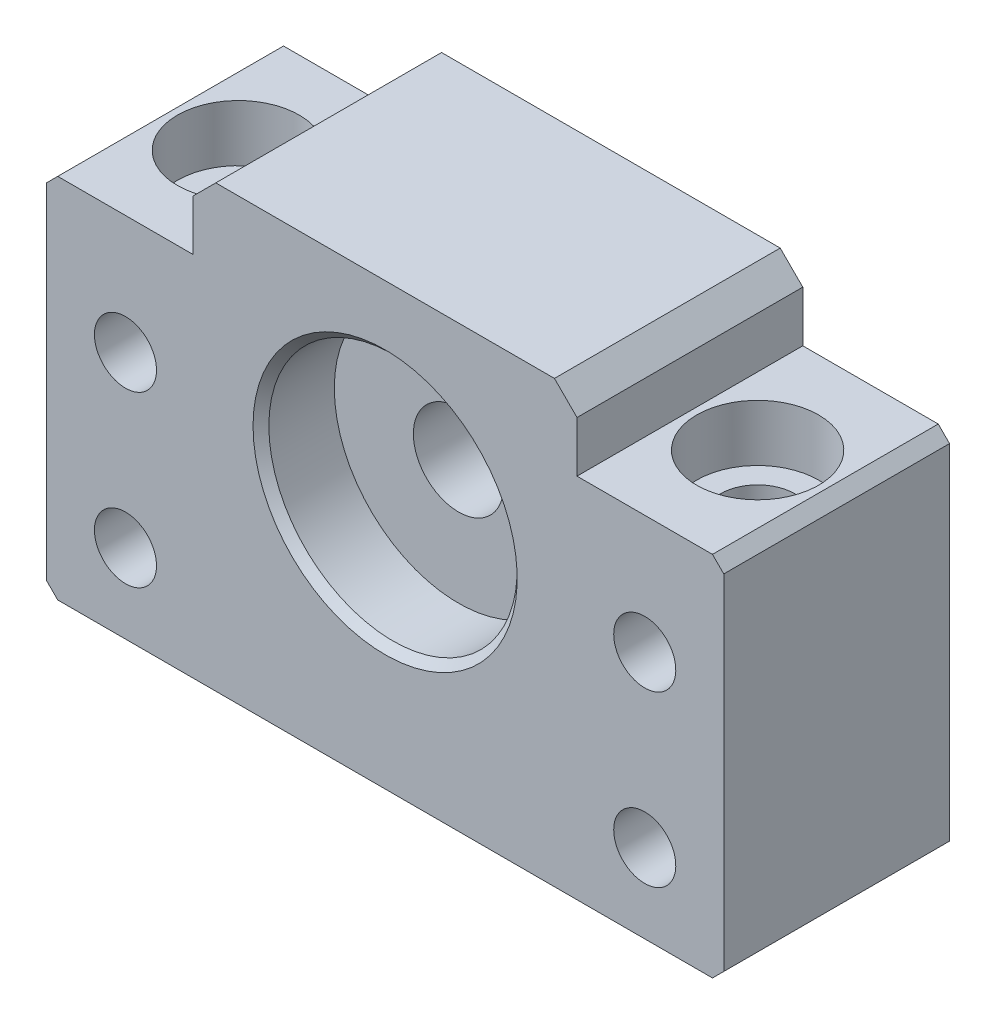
ISO-10303-21;
HEADER;
FILE_DESCRIPTION(('STEP AP214'),'2;1');
FILE_NAME('part.step','',(''),(''),'','','');
FILE_SCHEMA(('AUTOMOTIVE_DESIGN { 1 0 10303 214 1 1 1 1 }'));
ENDSEC;
DATA;
#1=APPLICATION_CONTEXT('core data for automotive mechanical design processes');
#2=APPLICATION_PROTOCOL_DEFINITION('international standard','automotive_design',2000,#1);
#3=PRODUCT_CONTEXT('',#1,'mechanical');
#4=PRODUCT('Part','Part','',(#3));
#5=PRODUCT_RELATED_PRODUCT_CATEGORY('part','',(#4));
#6=PRODUCT_DEFINITION_FORMATION('','',#4);
#7=PRODUCT_DEFINITION_CONTEXT('part definition',#1,'design');
#8=PRODUCT_DEFINITION('design','',#6,#7);
#9=PRODUCT_DEFINITION_SHAPE('','',#8);
#10=(LENGTH_UNIT() NAMED_UNIT(*) SI_UNIT(.MILLI.,.METRE.));
#11=(NAMED_UNIT(*) PLANE_ANGLE_UNIT() SI_UNIT($,.RADIAN.));
#12=(NAMED_UNIT(*) SI_UNIT($,.STERADIAN.) SOLID_ANGLE_UNIT());
#13=UNCERTAINTY_MEASURE_WITH_UNIT(LENGTH_MEASURE(1.E-05),#10,'distance_accuracy_value','');
#14=(GEOMETRIC_REPRESENTATION_CONTEXT(3) GLOBAL_UNCERTAINTY_ASSIGNED_CONTEXT((#13)) GLOBAL_UNIT_ASSIGNED_CONTEXT((#10,
#11,#12)) REPRESENTATION_CONTEXT('',''));
#15=CARTESIAN_POINT('',(0.,0.,0.));
#16=DIRECTION('',(0.,0.,1.));
#17=DIRECTION('',(1.,0.,0.));
#18=AXIS2_PLACEMENT_3D('',#15,#16,#17);
#19=CARTESIAN_POINT('',(0.,22.,-1.));
#20=DIRECTION('',(0.,0.,-1.));
#21=DIRECTION('',(-1.,0.,0.));
#22=AXIS2_PLACEMENT_3D('',#19,#20,#21);
#23=CYLINDRICAL_SURFACE('',#22,11.);
#24=CARTESIAN_POINT('',(0.,22.,13.5));
#25=DIRECTION('',(0.,0.,1.));
#26=DIRECTION('',(1.,0.,0.));
#27=AXIS2_PLACEMENT_3D('',#24,#25,#26);
#28=CIRCLE('',#27,11.);
#29=CARTESIAN_POINT('',(11.,22.,13.5));
#30=VERTEX_POINT('',#29);
#31=EDGE_CURVE('E11',#30,#30,#28,.T.);
#32=ORIENTED_EDGE('',*,*,#31,.F.);
#33=EDGE_LOOP('',(#32));
#34=FACE_BOUND('',#33,.T.);
#35=CARTESIAN_POINT('',(2.22044604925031E-13,22.,19.3));
#36=DIRECTION('',(0.,0.,-1.));
#37=DIRECTION('',(-1.,0.,0.));
#38=AXIS2_PLACEMENT_3D('',#35,#36,#37);
#39=CIRCLE('',#38,11.);
#40=CARTESIAN_POINT('',(-10.9999999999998,22.,19.3));
#41=VERTEX_POINT('',#40);
#42=EDGE_CURVE('E163',#41,#41,#39,.T.);
#43=ORIENTED_EDGE('',*,*,#42,.F.);
#44=EDGE_LOOP('',(#43));
#45=FACE_BOUND('',#44,.T.);
#46=ADVANCED_FACE('F16',(#34,#45),#23,.F.);
#47=CARTESIAN_POINT('',(-45.2499999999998,16.25,20.));
#48=DIRECTION('',(0.,0.,-1.));
#49=DIRECTION('',(-1.,0.,0.));
#50=AXIS2_PLACEMENT_3D('',#47,#48,#49);
#51=PLANE('',#50);
#52=CARTESIAN_POINT('',(23.0000000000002,7.00000000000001,20.));
#53=DIRECTION('',(0.,0.,-1.));
#54=DIRECTION('',(-1.,0.,0.));
#55=AXIS2_PLACEMENT_3D('',#52,#53,#54);
#56=CIRCLE('',#55,2.75);
#57=CARTESIAN_POINT('',(20.2500000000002,7.00000000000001,20.));
#58=VERTEX_POINT('',#57);
#59=EDGE_CURVE('E735',#58,#58,#56,.T.);
#60=ORIENTED_EDGE('',*,*,#59,.T.);
#61=EDGE_LOOP('',(#60));
#62=FACE_BOUND('',#61,.T.);
#63=CARTESIAN_POINT('',(23.0000000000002,22.,20.));
#64=DIRECTION('',(0.,0.,-1.));
#65=DIRECTION('',(-1.,0.,0.));
#66=AXIS2_PLACEMENT_3D('',#63,#64,#65);
#67=CIRCLE('',#66,2.75);
#68=CARTESIAN_POINT('',(20.2500000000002,22.,20.));
#69=VERTEX_POINT('',#68);
#70=EDGE_CURVE('E740',#69,#69,#67,.T.);
#71=ORIENTED_EDGE('',*,*,#70,.T.);
#72=EDGE_LOOP('',(#71));
#73=FACE_BOUND('',#72,.T.);
#74=CARTESIAN_POINT('',(-22.9999999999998,7.,20.));
#75=DIRECTION('',(0.,0.,-1.));
#76=DIRECTION('',(-1.,0.,0.));
#77=AXIS2_PLACEMENT_3D('',#74,#75,#76);
#78=CIRCLE('',#77,2.75);
#79=CARTESIAN_POINT('',(-25.7499999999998,7.,20.));
#80=VERTEX_POINT('',#79);
#81=EDGE_CURVE('E284',#80,#80,#78,.T.);
#82=ORIENTED_EDGE('',*,*,#81,.T.);
#83=EDGE_LOOP('',(#82));
#84=FACE_BOUND('',#83,.T.);
#85=CARTESIAN_POINT('',(-22.9999999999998,22.,20.));
#86=DIRECTION('',(0.,0.,-1.));
#87=DIRECTION('',(-1.,0.,0.));
#88=AXIS2_PLACEMENT_3D('',#85,#86,#87);
#89=CIRCLE('',#88,2.75);
#90=CARTESIAN_POINT('',(-25.7499999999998,22.,20.));
#91=VERTEX_POINT('',#90);
#92=EDGE_CURVE('E537',#91,#91,#89,.T.);
#93=ORIENTED_EDGE('',*,*,#92,.T.);
#94=EDGE_LOOP('',(#93));
#95=FACE_BOUND('',#94,.T.);
#96=DIRECTION('',(-0.707106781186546,0.707106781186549,0.));
#97=VECTOR('',#96,1.);
#98=CARTESIAN_POINT('',(-28.9999999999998,0.,20.));
#99=LINE('',#98,#97);
#100=CARTESIAN_POINT('',(-28.9999999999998,0.,20.));
#101=VERTEX_POINT('',#100);
#102=CARTESIAN_POINT('',(-29.9999999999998,1.,20.));
#103=VERTEX_POINT('',#102);
#104=EDGE_CURVE('E149',#101,#103,#99,.T.);
#105=ORIENTED_EDGE('',*,*,#104,.F.);
#106=DIRECTION('',(1.,0.,0.));
#107=VECTOR('',#106,1.);
#108=CARTESIAN_POINT('',(-28.9999999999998,0.,20.));
#109=LINE('',#108,#107);
#110=CARTESIAN_POINT('',(29.0000000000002,0.,20.));
#111=VERTEX_POINT('',#110);
#112=EDGE_CURVE('E131',#101,#111,#109,.T.);
#113=ORIENTED_EDGE('',*,*,#112,.T.);
#114=DIRECTION('',(0.707106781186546,0.707106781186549,0.));
#115=VECTOR('',#114,1.);
#116=CARTESIAN_POINT('',(29.0000000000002,0.,20.));
#117=LINE('',#116,#115);
#118=CARTESIAN_POINT('',(30.0000000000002,1.,20.));
#119=VERTEX_POINT('',#118);
#120=EDGE_CURVE('E169',#111,#119,#117,.T.);
#121=ORIENTED_EDGE('',*,*,#120,.T.);
#122=DIRECTION('',(0.,1.,0.));
#123=VECTOR('',#122,1.);
#124=CARTESIAN_POINT('',(30.0000000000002,1.,20.));
#125=LINE('',#124,#123);
#126=CARTESIAN_POINT('',(30.0000000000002,31.5,20.));
#127=VERTEX_POINT('',#126);
#128=EDGE_CURVE('E172',#119,#127,#125,.T.);
#129=ORIENTED_EDGE('',*,*,#128,.T.);
#130=DIRECTION('',(-0.707106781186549,0.707106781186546,0.));
#131=VECTOR('',#130,1.);
#132=CARTESIAN_POINT('',(30.0000000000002,31.5,20.));
#133=LINE('',#132,#131);
#134=CARTESIAN_POINT('',(29.0000000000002,32.5,20.));
#135=VERTEX_POINT('',#134);
#136=EDGE_CURVE('E175',#127,#135,#133,.T.);
#137=ORIENTED_EDGE('',*,*,#136,.T.);
#138=DIRECTION('',(-1.,0.,0.));
#139=VECTOR('',#138,1.);
#140=CARTESIAN_POINT('',(29.0000000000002,32.5,20.));
#141=LINE('',#140,#139);
#142=CARTESIAN_POINT('',(17.0000000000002,32.5,20.));
#143=VERTEX_POINT('',#142);
#144=EDGE_CURVE('E178',#135,#143,#141,.T.);
#145=ORIENTED_EDGE('',*,*,#144,.T.);
#146=DIRECTION('',(0.,1.,0.));
#147=VECTOR('',#146,1.);
#148=CARTESIAN_POINT('',(17.0000000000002,32.5,20.));
#149=LINE('',#148,#147);
#150=CARTESIAN_POINT('',(17.0000000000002,37.,20.));
#151=VERTEX_POINT('',#150);
#152=EDGE_CURVE('E181',#143,#151,#149,.T.);
#153=ORIENTED_EDGE('',*,*,#152,.T.);
#154=DIRECTION('',(-0.707106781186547,0.707106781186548,0.));
#155=VECTOR('',#154,1.);
#156=CARTESIAN_POINT('',(17.0000000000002,37.,20.));
#157=LINE('',#156,#155);
#158=CARTESIAN_POINT('',(15.0000000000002,39.,20.));
#159=VERTEX_POINT('',#158);
#160=EDGE_CURVE('E184',#151,#159,#157,.T.);
#161=ORIENTED_EDGE('',*,*,#160,.T.);
#162=DIRECTION('',(1.,0.,0.));
#163=VECTOR('',#162,1.);
#164=CARTESIAN_POINT('',(-14.9999999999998,39.,20.));
#165=LINE('',#164,#163);
#166=CARTESIAN_POINT('',(-14.9999999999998,39.,20.));
#167=VERTEX_POINT('',#166);
#168=EDGE_CURVE('E187',#167,#159,#165,.T.);
#169=ORIENTED_EDGE('',*,*,#168,.F.);
#170=DIRECTION('',(0.707106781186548,0.707106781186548,0.));
#171=VECTOR('',#170,1.);
#172=CARTESIAN_POINT('',(-16.9999999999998,37.,20.));
#173=LINE('',#172,#171);
#174=CARTESIAN_POINT('',(-16.9999999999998,37.,20.));
#175=VERTEX_POINT('',#174);
#176=EDGE_CURVE('E191',#175,#167,#173,.T.);
#177=ORIENTED_EDGE('',*,*,#176,.F.);
#178=DIRECTION('',(0.,1.,0.));
#179=VECTOR('',#178,1.);
#180=CARTESIAN_POINT('',(-16.9999999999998,32.5,20.));
#181=LINE('',#180,#179);
#182=CARTESIAN_POINT('',(-16.9999999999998,32.5,20.));
#183=VERTEX_POINT('',#182);
#184=EDGE_CURVE('E195',#183,#175,#181,.T.);
#185=ORIENTED_EDGE('',*,*,#184,.F.);
#186=DIRECTION('',(1.,0.,0.));
#187=VECTOR('',#186,1.);
#188=CARTESIAN_POINT('',(-28.9999999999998,32.5,20.));
#189=LINE('',#188,#187);
#190=CARTESIAN_POINT('',(-28.9999999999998,32.5,20.));
#191=VERTEX_POINT('',#190);
#192=EDGE_CURVE('E199',#191,#183,#189,.T.);
#193=ORIENTED_EDGE('',*,*,#192,.F.);
#194=DIRECTION('',(0.707106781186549,0.707106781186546,0.));
#195=VECTOR('',#194,1.);
#196=CARTESIAN_POINT('',(-29.9999999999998,31.5,20.));
#197=LINE('',#196,#195);
#198=CARTESIAN_POINT('',(-29.9999999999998,31.5,20.));
#199=VERTEX_POINT('',#198);
#200=EDGE_CURVE('E203',#199,#191,#197,.T.);
#201=ORIENTED_EDGE('',*,*,#200,.F.);
#202=DIRECTION('',(0.,1.,0.));
#203=VECTOR('',#202,1.);
#204=CARTESIAN_POINT('',(-29.9999999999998,1.,20.));
#205=LINE('',#204,#203);
#206=EDGE_CURVE('E206',#103,#199,#205,.T.);
#207=ORIENTED_EDGE('',*,*,#206,.F.);
#208=EDGE_LOOP('',(#105,#113,#121,#129,#137,#145,#153,#161,#169,#177,#185,#193,#201,#207));
#209=FACE_BOUND('',#208,.T.);
#210=CARTESIAN_POINT('',(2.22044604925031E-13,22.,20.));
#211=DIRECTION('',(0.,0.,-1.));
#212=DIRECTION('',(-1.,0.,0.));
#213=AXIS2_PLACEMENT_3D('',#210,#211,#212);
#214=CIRCLE('',#213,11.7);
#215=CARTESIAN_POINT('',(-11.6999999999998,22.,20.));
#216=VERTEX_POINT('',#215);
#217=EDGE_CURVE('E153',#216,#216,#214,.T.);
#218=ORIENTED_EDGE('',*,*,#217,.T.);
#219=EDGE_LOOP('',(#218));
#220=FACE_BOUND('',#219,.T.);
#221=ADVANCED_FACE('F357',(#62,#73,#84,#95,#209,#220),#51,.F.);
#222=CARTESIAN_POINT('',(-45.25,16.25,0.));
#223=DIRECTION('',(0.,0.,-1.));
#224=DIRECTION('',(-1.,0.,0.));
#225=AXIS2_PLACEMENT_3D('',#222,#223,#224);
#226=PLANE('',#225);
#227=CARTESIAN_POINT('',(23.,7.00000000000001,0.));
#228=DIRECTION('',(0.,0.,-1.));
#229=DIRECTION('',(-1.,0.,0.));
#230=AXIS2_PLACEMENT_3D('',#227,#228,#229);
#231=CIRCLE('',#230,2.75);
#232=CARTESIAN_POINT('',(20.25,7.00000000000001,0.));
#233=VERTEX_POINT('',#232);
#234=EDGE_CURVE('E524',#233,#233,#231,.T.);
#235=ORIENTED_EDGE('',*,*,#234,.F.);
#236=EDGE_LOOP('',(#235));
#237=FACE_BOUND('',#236,.T.);
#238=CARTESIAN_POINT('',(23.,22.,0.));
#239=DIRECTION('',(0.,0.,-1.));
#240=DIRECTION('',(-1.,0.,0.));
#241=AXIS2_PLACEMENT_3D('',#238,#239,#240);
#242=CIRCLE('',#241,2.75);
#243=CARTESIAN_POINT('',(20.25,22.,0.));
#244=VERTEX_POINT('',#243);
#245=EDGE_CURVE('E528',#244,#244,#242,.T.);
#246=ORIENTED_EDGE('',*,*,#245,.F.);
#247=EDGE_LOOP('',(#246));
#248=FACE_BOUND('',#247,.T.);
#249=CARTESIAN_POINT('',(-23.,7.,0.));
#250=DIRECTION('',(0.,0.,-1.));
#251=DIRECTION('',(-1.,0.,0.));
#252=AXIS2_PLACEMENT_3D('',#249,#250,#251);
#253=CIRCLE('',#252,2.75);
#254=CARTESIAN_POINT('',(-25.75,7.,0.));
#255=VERTEX_POINT('',#254);
#256=EDGE_CURVE('E532',#255,#255,#253,.T.);
#257=ORIENTED_EDGE('',*,*,#256,.F.);
#258=EDGE_LOOP('',(#257));
#259=FACE_BOUND('',#258,.T.);
#260=CARTESIAN_POINT('',(-23.,22.,0.));
#261=DIRECTION('',(0.,0.,-1.));
#262=DIRECTION('',(-1.,0.,0.));
#263=AXIS2_PLACEMENT_3D('',#260,#261,#262);
#264=CIRCLE('',#263,2.75);
#265=CARTESIAN_POINT('',(-25.75,22.,0.));
#266=VERTEX_POINT('',#265);
#267=EDGE_CURVE('E535',#266,#266,#264,.T.);
#268=ORIENTED_EDGE('',*,*,#267,.F.);
#269=EDGE_LOOP('',(#268));
#270=FACE_BOUND('',#269,.T.);
#271=DIRECTION('',(-0.707106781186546,0.707106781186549,0.));
#272=VECTOR('',#271,1.);
#273=CARTESIAN_POINT('',(-29.,0.,0.));
#274=LINE('',#273,#272);
#275=CARTESIAN_POINT('',(-29.,0.,0.));
#276=VERTEX_POINT('',#275);
#277=CARTESIAN_POINT('',(-30.,1.,0.));
#278=VERTEX_POINT('',#277);
#279=EDGE_CURVE('E145',#276,#278,#274,.T.);
#280=ORIENTED_EDGE('',*,*,#279,.T.);
#281=DIRECTION('',(0.,1.,0.));
#282=VECTOR('',#281,1.);
#283=CARTESIAN_POINT('',(-30.,1.,0.));
#284=LINE('',#283,#282);
#285=CARTESIAN_POINT('',(-30.,31.5,0.));
#286=VERTEX_POINT('',#285);
#287=EDGE_CURVE('E152',#278,#286,#284,.T.);
#288=ORIENTED_EDGE('',*,*,#287,.T.);
#289=DIRECTION('',(0.707106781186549,0.707106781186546,0.));
#290=VECTOR('',#289,1.);
#291=CARTESIAN_POINT('',(-30.,31.5,0.));
#292=LINE('',#291,#290);
#293=CARTESIAN_POINT('',(-29.,32.5,0.));
#294=VERTEX_POINT('',#293);
#295=EDGE_CURVE('E159',#286,#294,#292,.T.);
#296=ORIENTED_EDGE('',*,*,#295,.T.);
#297=DIRECTION('',(1.,0.,0.));
#298=VECTOR('',#297,1.);
#299=CARTESIAN_POINT('',(-29.,32.5,0.));
#300=LINE('',#299,#298);
#301=CARTESIAN_POINT('',(-17.,32.5,0.));
#302=VERTEX_POINT('',#301);
#303=EDGE_CURVE('E432',#294,#302,#300,.T.);
#304=ORIENTED_EDGE('',*,*,#303,.T.);
#305=DIRECTION('',(0.,1.,0.));
#306=VECTOR('',#305,1.);
#307=CARTESIAN_POINT('',(-17.,32.5,0.));
#308=LINE('',#307,#306);
#309=CARTESIAN_POINT('',(-17.,37.,0.));
#310=VERTEX_POINT('',#309);
#311=EDGE_CURVE('E428',#302,#310,#308,.T.);
#312=ORIENTED_EDGE('',*,*,#311,.T.);
#313=DIRECTION('',(0.707106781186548,0.707106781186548,0.));
#314=VECTOR('',#313,1.);
#315=CARTESIAN_POINT('',(-17.,37.,0.));
#316=LINE('',#315,#314);
#317=CARTESIAN_POINT('',(-15.,39.,0.));
#318=VERTEX_POINT('',#317);
#319=EDGE_CURVE('E424',#310,#318,#316,.T.);
#320=ORIENTED_EDGE('',*,*,#319,.T.);
#321=DIRECTION('',(1.,0.,0.));
#322=VECTOR('',#321,1.);
#323=CARTESIAN_POINT('',(-15.,39.,0.));
#324=LINE('',#323,#322);
#325=CARTESIAN_POINT('',(15.,39.,0.));
#326=VERTEX_POINT('',#325);
#327=EDGE_CURVE('E420',#318,#326,#324,.T.);
#328=ORIENTED_EDGE('',*,*,#327,.T.);
#329=DIRECTION('',(-0.707106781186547,0.707106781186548,0.));
#330=VECTOR('',#329,1.);
#331=CARTESIAN_POINT('',(17.,37.,0.));
#332=LINE('',#331,#330);
#333=CARTESIAN_POINT('',(17.,37.,0.));
#334=VERTEX_POINT('',#333);
#335=EDGE_CURVE('E416',#334,#326,#332,.T.);
#336=ORIENTED_EDGE('',*,*,#335,.F.);
#337=DIRECTION('',(0.,1.,0.));
#338=VECTOR('',#337,1.);
#339=CARTESIAN_POINT('',(17.,32.5,0.));
#340=LINE('',#339,#338);
#341=CARTESIAN_POINT('',(17.,32.5,0.));
#342=VERTEX_POINT('',#341);
#343=EDGE_CURVE('E413',#342,#334,#340,.T.);
#344=ORIENTED_EDGE('',*,*,#343,.F.);
#345=DIRECTION('',(-1.,0.,0.));
#346=VECTOR('',#345,1.);
#347=CARTESIAN_POINT('',(29.,32.5,0.));
#348=LINE('',#347,#346);
#349=CARTESIAN_POINT('',(29.,32.5,0.));
#350=VERTEX_POINT('',#349);
#351=EDGE_CURVE('E410',#350,#342,#348,.T.);
#352=ORIENTED_EDGE('',*,*,#351,.F.);
#353=DIRECTION('',(-0.707106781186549,0.707106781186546,0.));
#354=VECTOR('',#353,1.);
#355=CARTESIAN_POINT('',(30.,31.5,0.));
#356=LINE('',#355,#354);
#357=CARTESIAN_POINT('',(30.,31.5,0.));
#358=VERTEX_POINT('',#357);
#359=EDGE_CURVE('E407',#358,#350,#356,.T.);
#360=ORIENTED_EDGE('',*,*,#359,.F.);
#361=DIRECTION('',(0.,1.,0.));
#362=VECTOR('',#361,1.);
#363=CARTESIAN_POINT('',(30.,1.,0.));
#364=LINE('',#363,#362);
#365=CARTESIAN_POINT('',(30.,1.,0.));
#366=VERTEX_POINT('',#365);
#367=EDGE_CURVE('E404',#366,#358,#364,.T.);
#368=ORIENTED_EDGE('',*,*,#367,.F.);
#369=DIRECTION('',(0.707106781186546,0.707106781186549,0.));
#370=VECTOR('',#369,1.);
#371=CARTESIAN_POINT('',(29.,0.,0.));
#372=LINE('',#371,#370);
#373=CARTESIAN_POINT('',(29.,0.,0.));
#374=VERTEX_POINT('',#373);
#375=EDGE_CURVE('E147',#374,#366,#372,.T.);
#376=ORIENTED_EDGE('',*,*,#375,.F.);
#377=DIRECTION('',(1.,0.,0.));
#378=VECTOR('',#377,1.);
#379=CARTESIAN_POINT('',(-29.,0.,0.));
#380=LINE('',#379,#378);
#381=EDGE_CURVE('E129',#276,#374,#380,.T.);
#382=ORIENTED_EDGE('',*,*,#381,.F.);
#383=EDGE_LOOP('',(#280,#288,#296,#304,#312,#320,#328,#336,#344,#352,#360,#368,#376,#382));
#384=FACE_BOUND('',#383,.T.);
#385=CARTESIAN_POINT('',(0.,22.,0.));
#386=DIRECTION('',(0.,0.,-1.));
#387=DIRECTION('',(-1.,0.,0.));
#388=AXIS2_PLACEMENT_3D('',#385,#386,#387);
#389=CIRCLE('',#388,11.7);
#390=CARTESIAN_POINT('',(-11.7,22.,0.));
#391=VERTEX_POINT('',#390);
#392=EDGE_CURVE('E389',#391,#391,#389,.T.);
#393=ORIENTED_EDGE('',*,*,#392,.F.);
#394=EDGE_LOOP('',(#393));
#395=FACE_BOUND('',#394,.T.);
#396=ADVANCED_FACE('F142',(#237,#248,#259,#270,#384,#395),#226,.T.);
#397=CARTESIAN_POINT('',(-28.9999999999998,0.,20.));
#398=DIRECTION('',(-0.707106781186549,-0.707106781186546,0.));
#399=DIRECTION('',(0.707106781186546,-0.707106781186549,0.));
#400=AXIS2_PLACEMENT_3D('',#397,#398,#399);
#401=PLANE('',#400);
#402=ORIENTED_EDGE('',*,*,#279,.F.);
#403=DIRECTION('',(0.,0.,-1.));
#404=VECTOR('',#403,1.);
#405=CARTESIAN_POINT('',(-28.9999999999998,0.,20.));
#406=LINE('',#405,#404);
#407=EDGE_CURVE('E125',#101,#276,#406,.T.);
#408=ORIENTED_EDGE('',*,*,#407,.F.);
#409=ORIENTED_EDGE('',*,*,#104,.T.);
#410=DIRECTION('',(0.,0.,-1.));
#411=VECTOR('',#410,1.);
#412=CARTESIAN_POINT('',(-29.9999999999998,1.,20.));
#413=LINE('',#412,#411);
#414=EDGE_CURVE('E38',#103,#278,#413,.T.);
#415=ORIENTED_EDGE('',*,*,#414,.T.);
#416=EDGE_LOOP('',(#402,#408,#409,#415));
#417=FACE_BOUND('',#416,.T.);
#418=ADVANCED_FACE('F18',(#417),#401,.T.);
#419=CARTESIAN_POINT('',(-28.9999999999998,0.,20.));
#420=DIRECTION('',(0.,1.,0.));
#421=DIRECTION('',(0.,0.,1.));
#422=AXIS2_PLACEMENT_3D('',#419,#420,#421);
#423=PLANE('',#422);
#424=CARTESIAN_POINT('',(23.,0.,9.99999999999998));
#425=DIRECTION('',(0.,1.,0.));
#426=DIRECTION('',(0.,0.,1.));
#427=AXIS2_PLACEMENT_3D('',#424,#425,#426);
#428=CIRCLE('',#427,3.3);
#429=CARTESIAN_POINT('',(23.,0.,13.3));
#430=VERTEX_POINT('',#429);
#431=EDGE_CURVE('E269',#430,#430,#428,.T.);
#432=ORIENTED_EDGE('',*,*,#431,.T.);
#433=EDGE_LOOP('',(#432));
#434=FACE_BOUND('',#433,.T.);
#435=CARTESIAN_POINT('',(-23.,0.,9.99999999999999));
#436=DIRECTION('',(0.,1.,0.));
#437=DIRECTION('',(0.,0.,1.));
#438=AXIS2_PLACEMENT_3D('',#435,#436,#437);
#439=CIRCLE('',#438,3.3);
#440=CARTESIAN_POINT('',(-23.,0.,13.3));
#441=VERTEX_POINT('',#440);
#442=EDGE_CURVE('E259',#441,#441,#439,.T.);
#443=ORIENTED_EDGE('',*,*,#442,.T.);
#444=EDGE_LOOP('',(#443));
#445=FACE_BOUND('',#444,.T.);
#446=ORIENTED_EDGE('',*,*,#381,.T.);
#447=DIRECTION('',(0.,0.,-1.));
#448=VECTOR('',#447,1.);
#449=CARTESIAN_POINT('',(29.0000000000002,0.,20.));
#450=LINE('',#449,#448);
#451=EDGE_CURVE('E137',#111,#374,#450,.T.);
#452=ORIENTED_EDGE('',*,*,#451,.F.);
#453=ORIENTED_EDGE('',*,*,#112,.F.);
#454=ORIENTED_EDGE('',*,*,#407,.T.);
#455=EDGE_LOOP('',(#446,#452,#453,#454));
#456=FACE_BOUND('',#455,.T.);
#457=ADVANCED_FACE('F127',(#434,#445,#456),#423,.F.);
#458=CARTESIAN_POINT('',(29.0000000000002,0.,20.));
#459=DIRECTION('',(-0.707106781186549,0.707106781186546,0.));
#460=DIRECTION('',(-0.707106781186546,-0.707106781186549,0.));
#461=AXIS2_PLACEMENT_3D('',#458,#459,#460);
#462=PLANE('',#461);
#463=ORIENTED_EDGE('',*,*,#375,.T.);
#464=DIRECTION('',(0.,0.,-1.));
#465=VECTOR('',#464,1.);
#466=CARTESIAN_POINT('',(30.0000000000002,1.,20.));
#467=LINE('',#466,#465);
#468=EDGE_CURVE('E246',#119,#366,#467,.T.);
#469=ORIENTED_EDGE('',*,*,#468,.F.);
#470=ORIENTED_EDGE('',*,*,#120,.F.);
#471=ORIENTED_EDGE('',*,*,#451,.T.);
#472=EDGE_LOOP('',(#463,#469,#470,#471));
#473=FACE_BOUND('',#472,.T.);
#474=ADVANCED_FACE('F482',(#473),#462,.F.);
#475=CARTESIAN_POINT('',(30.0000000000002,1.,20.));
#476=DIRECTION('',(-1.,0.,0.));
#477=DIRECTION('',(0.,-1.,0.));
#478=AXIS2_PLACEMENT_3D('',#475,#476,#477);
#479=PLANE('',#478);
#480=ORIENTED_EDGE('',*,*,#367,.T.);
#481=DIRECTION('',(0.,0.,-1.));
#482=VECTOR('',#481,1.);
#483=CARTESIAN_POINT('',(30.0000000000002,31.5,20.));
#484=LINE('',#483,#482);
#485=EDGE_CURVE('E242',#127,#358,#484,.T.);
#486=ORIENTED_EDGE('',*,*,#485,.F.);
#487=ORIENTED_EDGE('',*,*,#128,.F.);
#488=ORIENTED_EDGE('',*,*,#468,.T.);
#489=EDGE_LOOP('',(#480,#486,#487,#488));
#490=FACE_BOUND('',#489,.T.);
#491=ADVANCED_FACE('F477',(#490),#479,.F.);
#492=CARTESIAN_POINT('',(30.0000000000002,31.5,20.));
#493=DIRECTION('',(-0.707106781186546,-0.707106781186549,0.));
#494=DIRECTION('',(0.707106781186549,-0.707106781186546,0.));
#495=AXIS2_PLACEMENT_3D('',#492,#493,#494);
#496=PLANE('',#495);
#497=ORIENTED_EDGE('',*,*,#359,.T.);
#498=DIRECTION('',(0.,0.,-1.));
#499=VECTOR('',#498,1.);
#500=CARTESIAN_POINT('',(29.0000000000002,32.5,20.));
#501=LINE('',#500,#499);
#502=EDGE_CURVE('E238',#135,#350,#501,.T.);
#503=ORIENTED_EDGE('',*,*,#502,.F.);
#504=ORIENTED_EDGE('',*,*,#136,.F.);
#505=ORIENTED_EDGE('',*,*,#485,.T.);
#506=EDGE_LOOP('',(#497,#503,#504,#505));
#507=FACE_BOUND('',#506,.T.);
#508=ADVANCED_FACE('F474',(#507),#496,.F.);
#509=CARTESIAN_POINT('',(29.0000000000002,32.5,20.));
#510=DIRECTION('',(0.,-1.,0.));
#511=DIRECTION('',(0.,0.,-1.));
#512=AXIS2_PLACEMENT_3D('',#509,#510,#511);
#513=PLANE('',#512);
#514=CARTESIAN_POINT('',(23.,32.5,9.99999999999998));
#515=DIRECTION('',(0.,-1.,0.));
#516=DIRECTION('',(0.,0.,-1.));
#517=AXIS2_PLACEMENT_3D('',#514,#515,#516);
#518=CIRCLE('',#517,5.4);
#519=CARTESIAN_POINT('',(23.,32.5,4.59999999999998));
#520=VERTEX_POINT('',#519);
#521=EDGE_CURVE('E265',#520,#520,#518,.T.);
#522=ORIENTED_EDGE('',*,*,#521,.T.);
#523=EDGE_LOOP('',(#522));
#524=FACE_BOUND('',#523,.T.);
#525=ORIENTED_EDGE('',*,*,#351,.T.);
#526=DIRECTION('',(0.,0.,-1.));
#527=VECTOR('',#526,1.);
#528=CARTESIAN_POINT('',(17.0000000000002,32.5,20.));
#529=LINE('',#528,#527);
#530=EDGE_CURVE('E234',#143,#342,#529,.T.);
#531=ORIENTED_EDGE('',*,*,#530,.F.);
#532=ORIENTED_EDGE('',*,*,#144,.F.);
#533=ORIENTED_EDGE('',*,*,#502,.T.);
#534=EDGE_LOOP('',(#525,#531,#532,#533));
#535=FACE_BOUND('',#534,.T.);
#536=ADVANCED_FACE('F470',(#524,#535),#513,.F.);
#537=CARTESIAN_POINT('',(17.0000000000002,32.5,20.));
#538=DIRECTION('',(-1.,0.,0.));
#539=DIRECTION('',(0.,0.,1.));
#540=AXIS2_PLACEMENT_3D('',#537,#538,#539);
#541=PLANE('',#540);
#542=ORIENTED_EDGE('',*,*,#343,.T.);
#543=DIRECTION('',(0.,0.,-1.));
#544=VECTOR('',#543,1.);
#545=CARTESIAN_POINT('',(17.0000000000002,37.,20.));
#546=LINE('',#545,#544);
#547=EDGE_CURVE('E230',#151,#334,#546,.T.);
#548=ORIENTED_EDGE('',*,*,#547,.F.);
#549=ORIENTED_EDGE('',*,*,#152,.F.);
#550=ORIENTED_EDGE('',*,*,#530,.T.);
#551=EDGE_LOOP('',(#542,#548,#549,#550));
#552=FACE_BOUND('',#551,.T.);
#553=ADVANCED_FACE('F465',(#552),#541,.F.);
#554=CARTESIAN_POINT('',(17.0000000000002,37.,20.));
#555=DIRECTION('',(-0.707106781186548,-0.707106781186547,0.));
#556=DIRECTION('',(0.707106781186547,-0.707106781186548,0.));
#557=AXIS2_PLACEMENT_3D('',#554,#555,#556);
#558=PLANE('',#557);
#559=ORIENTED_EDGE('',*,*,#335,.T.);
#560=DIRECTION('',(0.,0.,-1.));
#561=VECTOR('',#560,1.);
#562=CARTESIAN_POINT('',(15.0000000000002,39.,20.));
#563=LINE('',#562,#561);
#564=EDGE_CURVE('E227',#159,#326,#563,.T.);
#565=ORIENTED_EDGE('',*,*,#564,.F.);
#566=ORIENTED_EDGE('',*,*,#160,.F.);
#567=ORIENTED_EDGE('',*,*,#547,.T.);
#568=EDGE_LOOP('',(#559,#565,#566,#567));
#569=FACE_BOUND('',#568,.T.);
#570=ADVANCED_FACE('F459',(#569),#558,.F.);
#571=CARTESIAN_POINT('',(-14.9999999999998,39.,20.));
#572=DIRECTION('',(0.,1.,0.));
#573=DIRECTION('',(0.,0.,1.));
#574=AXIS2_PLACEMENT_3D('',#571,#572,#573);
#575=PLANE('',#574);
#576=ORIENTED_EDGE('',*,*,#327,.F.);
#577=DIRECTION('',(0.,0.,-1.));
#578=VECTOR('',#577,1.);
#579=CARTESIAN_POINT('',(-14.9999999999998,39.,20.));
#580=LINE('',#579,#578);
#581=EDGE_CURVE('E224',#167,#318,#580,.T.);
#582=ORIENTED_EDGE('',*,*,#581,.F.);
#583=ORIENTED_EDGE('',*,*,#168,.T.);
#584=ORIENTED_EDGE('',*,*,#564,.T.);
#585=EDGE_LOOP('',(#576,#582,#583,#584));
#586=FACE_BOUND('',#585,.T.);
#587=ADVANCED_FACE('F455',(#586),#575,.T.);
#588=CARTESIAN_POINT('',(-16.9999999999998,37.,20.));
#589=DIRECTION('',(-0.707106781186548,0.707106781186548,0.));
#590=DIRECTION('',(-0.707106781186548,-0.707106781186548,0.));
#591=AXIS2_PLACEMENT_3D('',#588,#589,#590);
#592=PLANE('',#591);
#593=ORIENTED_EDGE('',*,*,#319,.F.);
#594=DIRECTION('',(0.,0.,-1.));
#595=VECTOR('',#594,1.);
#596=CARTESIAN_POINT('',(-16.9999999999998,37.,20.));
#597=LINE('',#596,#595);
#598=EDGE_CURVE('E221',#175,#310,#597,.T.);
#599=ORIENTED_EDGE('',*,*,#598,.F.);
#600=ORIENTED_EDGE('',*,*,#176,.T.);
#601=ORIENTED_EDGE('',*,*,#581,.T.);
#602=EDGE_LOOP('',(#593,#599,#600,#601));
#603=FACE_BOUND('',#602,.T.);
#604=ADVANCED_FACE('F451',(#603),#592,.T.);
#605=CARTESIAN_POINT('',(-16.9999999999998,32.5,20.));
#606=DIRECTION('',(-1.,0.,0.));
#607=DIRECTION('',(0.,0.,1.));
#608=AXIS2_PLACEMENT_3D('',#605,#606,#607);
#609=PLANE('',#608);
#610=ORIENTED_EDGE('',*,*,#311,.F.);
#611=DIRECTION('',(0.,0.,-1.));
#612=VECTOR('',#611,1.);
#613=CARTESIAN_POINT('',(-16.9999999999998,32.5,20.));
#614=LINE('',#613,#612);
#615=EDGE_CURVE('E218',#183,#302,#614,.T.);
#616=ORIENTED_EDGE('',*,*,#615,.F.);
#617=ORIENTED_EDGE('',*,*,#184,.T.);
#618=ORIENTED_EDGE('',*,*,#598,.T.);
#619=EDGE_LOOP('',(#610,#616,#617,#618));
#620=FACE_BOUND('',#619,.T.);
#621=ADVANCED_FACE('F446',(#620),#609,.T.);
#622=CARTESIAN_POINT('',(-28.9999999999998,32.5,20.));
#623=DIRECTION('',(0.,1.,0.));
#624=DIRECTION('',(0.,0.,1.));
#625=AXIS2_PLACEMENT_3D('',#622,#623,#624);
#626=PLANE('',#625);
#627=CARTESIAN_POINT('',(-23.,32.5,9.99999999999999));
#628=DIRECTION('',(0.,1.,0.));
#629=DIRECTION('',(0.,0.,1.));
#630=AXIS2_PLACEMENT_3D('',#627,#628,#629);
#631=CIRCLE('',#630,5.4);
#632=CARTESIAN_POINT('',(-23.,32.5,15.4));
#633=VERTEX_POINT('',#632);
#634=EDGE_CURVE('E255',#633,#633,#631,.T.);
#635=ORIENTED_EDGE('',*,*,#634,.F.);
#636=EDGE_LOOP('',(#635));
#637=FACE_BOUND('',#636,.T.);
#638=ORIENTED_EDGE('',*,*,#303,.F.);
#639=DIRECTION('',(0.,0.,-1.));
#640=VECTOR('',#639,1.);
#641=CARTESIAN_POINT('',(-28.9999999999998,32.5,20.));
#642=LINE('',#641,#640);
#643=EDGE_CURVE('E215',#191,#294,#642,.T.);
#644=ORIENTED_EDGE('',*,*,#643,.F.);
#645=ORIENTED_EDGE('',*,*,#192,.T.);
#646=ORIENTED_EDGE('',*,*,#615,.T.);
#647=EDGE_LOOP('',(#638,#644,#645,#646));
#648=FACE_BOUND('',#647,.T.);
#649=ADVANCED_FACE('F442',(#637,#648),#626,.T.);
#650=CARTESIAN_POINT('',(-29.9999999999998,31.5,20.));
#651=DIRECTION('',(-0.707106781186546,0.707106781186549,0.));
#652=DIRECTION('',(-0.707106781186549,-0.707106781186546,0.));
#653=AXIS2_PLACEMENT_3D('',#650,#651,#652);
#654=PLANE('',#653);
#655=ORIENTED_EDGE('',*,*,#295,.F.);
#656=DIRECTION('',(0.,0.,-1.));
#657=VECTOR('',#656,1.);
#658=CARTESIAN_POINT('',(-29.9999999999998,31.5,20.));
#659=LINE('',#658,#657);
#660=EDGE_CURVE('E46',#199,#286,#659,.T.);
#661=ORIENTED_EDGE('',*,*,#660,.F.);
#662=ORIENTED_EDGE('',*,*,#200,.T.);
#663=ORIENTED_EDGE('',*,*,#643,.T.);
#664=EDGE_LOOP('',(#655,#661,#662,#663));
#665=FACE_BOUND('',#664,.T.);
#666=ADVANCED_FACE('F439',(#665),#654,.T.);
#667=CARTESIAN_POINT('',(-29.9999999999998,1.,20.));
#668=DIRECTION('',(-1.,0.,0.));
#669=DIRECTION('',(0.,0.,1.));
#670=AXIS2_PLACEMENT_3D('',#667,#668,#669);
#671=PLANE('',#670);
#672=ORIENTED_EDGE('',*,*,#287,.F.);
#673=ORIENTED_EDGE('',*,*,#414,.F.);
#674=ORIENTED_EDGE('',*,*,#206,.T.);
#675=ORIENTED_EDGE('',*,*,#660,.T.);
#676=EDGE_LOOP('',(#672,#673,#674,#675));
#677=FACE_BOUND('',#676,.T.);
#678=ADVANCED_FACE('F380',(#677),#671,.T.);
#679=CARTESIAN_POINT('',(2.22044604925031E-13,22.,20.));
#680=DIRECTION('',(0.,0.,1.));
#681=DIRECTION('',(1.,0.,0.));
#682=AXIS2_PLACEMENT_3D('',#679,#680,#681);
#683=CONICAL_SURFACE('',#682,11.7,0.785398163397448);
#684=ORIENTED_EDGE('',*,*,#42,.T.);
#685=EDGE_LOOP('',(#684));
#686=FACE_BOUND('',#685,.T.);
#687=ORIENTED_EDGE('',*,*,#217,.F.);
#688=EDGE_LOOP('',(#687));
#689=FACE_BOUND('',#688,.T.);
#690=ADVANCED_FACE('F372',(#686,#689),#683,.F.);
#691=CARTESIAN_POINT('',(0.,22.,6.50000000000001));
#692=DIRECTION('',(0.,0.,-1.));
#693=DIRECTION('',(-1.,0.,0.));
#694=AXIS2_PLACEMENT_3D('',#691,#692,#693);
#695=CIRCLE('',#694,11.);
#696=CARTESIAN_POINT('',(-11.,22.,6.50000000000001));
#697=VERTEX_POINT('',#696);
#698=EDGE_CURVE('E30',#697,#697,#695,.T.);
#699=ORIENTED_EDGE('',*,*,#698,.F.);
#700=EDGE_LOOP('',(#699));
#701=FACE_BOUND('',#700,.T.);
#702=CARTESIAN_POINT('',(0.,22.,0.700000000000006));
#703=DIRECTION('',(0.,0.,-1.));
#704=DIRECTION('',(-1.,0.,0.));
#705=AXIS2_PLACEMENT_3D('',#702,#703,#704);
#706=CIRCLE('',#705,11.);
#707=CARTESIAN_POINT('',(-11.,22.,0.700000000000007));
#708=VERTEX_POINT('',#707);
#709=EDGE_CURVE('E386',#708,#708,#706,.T.);
#710=ORIENTED_EDGE('',*,*,#709,.T.);
#711=EDGE_LOOP('',(#710));
#712=FACE_BOUND('',#711,.T.);
#713=ADVANCED_FACE('F360',(#701,#712),#23,.F.);
#714=CARTESIAN_POINT('',(0.,22.,0.700000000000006));
#715=DIRECTION('',(0.,0.,-1.));
#716=DIRECTION('',(-1.,0.,0.));
#717=AXIS2_PLACEMENT_3D('',#714,#715,#716);
#718=CONICAL_SURFACE('',#717,11.,0.785398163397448);
#719=ORIENTED_EDGE('',*,*,#392,.T.);
#720=EDGE_LOOP('',(#719));
#721=FACE_BOUND('',#720,.T.);
#722=ORIENTED_EDGE('',*,*,#709,.F.);
#723=EDGE_LOOP('',(#722));
#724=FACE_BOUND('',#723,.T.);
#725=ADVANCED_FACE('F371',(#721,#724),#718,.F.);
#726=CARTESIAN_POINT('',(0.,22.,13.5));
#727=DIRECTION('',(0.,0.,1.));
#728=DIRECTION('',(1.,0.,0.));
#729=AXIS2_PLACEMENT_3D('',#726,#727,#728);
#730=PLANE('',#729);
#731=ORIENTED_EDGE('',*,*,#31,.T.);
#732=EDGE_LOOP('',(#731));
#733=FACE_BOUND('',#732,.T.);
#734=CARTESIAN_POINT('',(0.,22.,13.5));
#735=DIRECTION('',(0.,0.,1.));
#736=DIRECTION('',(1.,0.,0.));
#737=AXIS2_PLACEMENT_3D('',#734,#735,#736);
#738=CIRCLE('',#737,4.);
#739=CARTESIAN_POINT('',(4.,22.,13.5));
#740=VERTEX_POINT('',#739);
#741=EDGE_CURVE('E398',#740,#740,#738,.T.);
#742=ORIENTED_EDGE('',*,*,#741,.F.);
#743=EDGE_LOOP('',(#742));
#744=FACE_BOUND('',#743,.T.);
#745=ADVANCED_FACE('F378',(#733,#744),#730,.T.);
#746=CARTESIAN_POINT('',(0.,22.,6.50000000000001));
#747=DIRECTION('',(0.,0.,-1.));
#748=DIRECTION('',(-1.,0.,0.));
#749=AXIS2_PLACEMENT_3D('',#746,#747,#748);
#750=PLANE('',#749);
#751=ORIENTED_EDGE('',*,*,#698,.T.);
#752=EDGE_LOOP('',(#751));
#753=FACE_BOUND('',#752,.T.);
#754=CARTESIAN_POINT('',(0.,22.,6.50000000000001));
#755=DIRECTION('',(0.,0.,-1.));
#756=DIRECTION('',(-1.,0.,0.));
#757=AXIS2_PLACEMENT_3D('',#754,#755,#756);
#758=CIRCLE('',#757,4.);
#759=CARTESIAN_POINT('',(-4.,22.,6.50000000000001));
#760=VERTEX_POINT('',#759);
#761=EDGE_CURVE('E264',#760,#760,#758,.T.);
#762=ORIENTED_EDGE('',*,*,#761,.F.);
#763=EDGE_LOOP('',(#762));
#764=FACE_BOUND('',#763,.T.);
#765=ADVANCED_FACE('F573',(#753,#764),#750,.T.);
#766=CARTESIAN_POINT('',(0.,22.,0.));
#767=DIRECTION('',(0.,0.,1.));
#768=DIRECTION('',(0.,1.,0.));
#769=AXIS2_PLACEMENT_3D('',#766,#767,#768);
#770=CYLINDRICAL_SURFACE('',#769,4.);
#771=ORIENTED_EDGE('',*,*,#741,.T.);
#772=EDGE_LOOP('',(#771));
#773=FACE_BOUND('',#772,.T.);
#774=ORIENTED_EDGE('',*,*,#761,.T.);
#775=EDGE_LOOP('',(#774));
#776=FACE_BOUND('',#775,.T.);
#777=ADVANCED_FACE('F571',(#773,#776),#770,.F.);
#778=CARTESIAN_POINT('',(-23.,-1.,9.99999999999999));
#779=DIRECTION('',(0.,1.,0.));
#780=DIRECTION('',(1.,0.,0.));
#781=AXIS2_PLACEMENT_3D('',#778,#779,#780);
#782=CYLINDRICAL_SURFACE('',#781,3.3);
#783=CARTESIAN_POINT('',(-23.,9.75,6.7));
#784=CARTESIAN_POINT('',(-22.8693667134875,9.74999462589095,6.70000524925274));
#785=CARTESIAN_POINT('',(-22.7386935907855,9.74062524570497,6.70782462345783));
#786=CARTESIAN_POINT('',(-22.481699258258,9.70384100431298,6.73838160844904));
#787=CARTESIAN_POINT('',(-22.3553813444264,9.67641277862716,6.76113026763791));
#788=CARTESIAN_POINT('',(-22.111387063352,9.60555667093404,6.81943040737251));
#789=CARTESIAN_POINT('',(-21.9936639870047,9.56222441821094,6.85490533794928));
#790=CARTESIAN_POINT('',(-21.7681744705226,9.46178124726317,6.936179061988));
#791=CARTESIAN_POINT('',(-21.6604114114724,9.40466567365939,6.98198134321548));
#792=CARTESIAN_POINT('',(-21.4183100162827,9.25560087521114,7.09958389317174));
#793=CARTESIAN_POINT('',(-21.2887495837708,9.15856277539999,7.17475395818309));
#794=CARTESIAN_POINT('',(-21.0507736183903,8.94642324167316,7.33335112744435));
#795=CARTESIAN_POINT('',(-20.9424187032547,8.83127167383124,7.41680090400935));
#796=CARTESIAN_POINT('',(-20.7951900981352,8.6455072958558,7.54375625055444));
#797=CARTESIAN_POINT('',(-20.748303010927,8.58074886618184,7.58677952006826));
#798=CARTESIAN_POINT('',(-20.6601317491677,8.44704383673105,7.67217327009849));
#799=CARTESIAN_POINT('',(-20.6188494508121,8.37809584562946,7.71454352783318));
#800=CARTESIAN_POINT('',(-20.5421476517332,8.23610594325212,7.79724402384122));
#801=CARTESIAN_POINT('',(-20.5067143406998,8.16307423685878,7.83757890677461));
#802=CARTESIAN_POINT('',(-20.4419094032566,8.01260908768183,7.91464544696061));
#803=CARTESIAN_POINT('',(-20.4125326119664,7.93517946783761,7.95138016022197));
#804=CARTESIAN_POINT('',(-20.3578713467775,7.76816620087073,8.02228889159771));
#805=CARTESIAN_POINT('',(-20.3332281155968,7.67812349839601,8.05590057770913));
#806=CARTESIAN_POINT('',(-20.2928855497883,7.49292125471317,8.11247501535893));
#807=CARTESIAN_POINT('',(-20.2771645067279,7.3977747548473,8.13546358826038));
#808=CARTESIAN_POINT('',(-20.2557081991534,7.20265805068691,8.16716978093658));
#809=CARTESIAN_POINT('',(-20.2500967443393,7.10264324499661,8.17571038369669));
#810=CARTESIAN_POINT('',(-20.2499057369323,6.9025811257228,8.17599860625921));
#811=CARTESIAN_POINT('',(-20.2553263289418,6.80253381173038,8.1677460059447));
#812=CARTESIAN_POINT('',(-20.2774421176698,6.59792281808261,8.13504196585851));
#813=CARTESIAN_POINT('',(-20.2950386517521,6.49367687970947,8.10929874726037));
#814=CARTESIAN_POINT('',(-20.3408319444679,6.29136792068,8.04542940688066));
#815=CARTESIAN_POINT('',(-20.3690638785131,6.19332669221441,8.00726225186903));
#816=CARTESIAN_POINT('',(-20.4280210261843,6.02339021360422,7.93197551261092));
#817=CARTESIAN_POINT('',(-20.4570473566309,5.9502565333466,7.89624651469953));
#818=CARTESIAN_POINT('',(-20.5205513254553,5.80798411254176,7.82175803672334));
#819=CARTESIAN_POINT('',(-20.5550321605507,5.73884774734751,7.78299678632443));
#820=CARTESIAN_POINT('',(-20.6663535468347,5.53703647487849,7.66423087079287));
#821=CARTESIAN_POINT('',(-20.7510426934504,5.41004443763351,7.58178533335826));
#822=CARTESIAN_POINT('',(-20.9455749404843,5.16490634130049,7.41412112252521));
#823=CARTESIAN_POINT('',(-21.0565001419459,5.04756784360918,7.32898228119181));
#824=CARTESIAN_POINT('',(-21.3006717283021,4.83177642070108,7.16740040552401));
#825=CARTESIAN_POINT('',(-21.4338687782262,4.73328276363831,7.09093876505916));
#826=CARTESIAN_POINT('',(-21.6864770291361,4.58064367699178,6.97028194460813));
#827=CARTESIAN_POINT('',(-21.8012999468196,4.52154281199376,6.92276814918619));
#828=CARTESIAN_POINT('',(-22.0418213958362,4.41902298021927,6.83961415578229));
#829=CARTESIAN_POINT('',(-22.1675130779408,4.37559422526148,6.80396654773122));
#830=CARTESIAN_POINT('',(-22.4280502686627,4.30674102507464,6.74719182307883));
#831=CARTESIAN_POINT('',(-22.5629579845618,4.28145565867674,6.72617690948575));
#832=CARTESIAN_POINT('',(-22.8365840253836,4.25141984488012,6.70119422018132));
#833=CARTESIAN_POINT('',(-22.9752997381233,4.24665565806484,6.69721503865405));
#834=CARTESIAN_POINT('',(-23.2346412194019,4.25732868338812,6.70610501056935));
#835=CARTESIAN_POINT('',(-23.3554435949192,4.27041450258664,6.71701314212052));
#836=CARTESIAN_POINT('',(-23.5925094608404,4.31189364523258,6.75141851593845));
#837=CARTESIAN_POINT('',(-23.7087724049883,4.34028880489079,6.77491726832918));
#838=CARTESIAN_POINT('',(-23.935622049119,4.4112857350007,6.83321526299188));
#839=CARTESIAN_POINT('',(-24.0461117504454,4.4540728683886,6.8681617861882));
#840=CARTESIAN_POINT('',(-24.2580249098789,4.55183519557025,6.94710262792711));
#841=CARTESIAN_POINT('',(-24.3594449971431,4.60681489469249,6.99110029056));
#842=CARTESIAN_POINT('',(-24.5957418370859,4.7542749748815,7.10727332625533));
#843=CARTESIAN_POINT('',(-24.7251779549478,4.85250584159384,7.183227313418));
#844=CARTESIAN_POINT('',(-24.9627189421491,5.06712442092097,7.34325310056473));
#845=CARTESIAN_POINT('',(-25.0707553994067,5.18356830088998,7.42734969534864));
#846=CARTESIAN_POINT('',(-25.217306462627,5.3713531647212,7.55503213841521));
#847=CARTESIAN_POINT('',(-25.2639217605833,5.4367881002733,7.59824733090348));
#848=CARTESIAN_POINT('',(-25.3514883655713,5.5718928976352,7.68391530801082));
#849=CARTESIAN_POINT('',(-25.3924376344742,5.6415642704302,7.72636781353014));
#850=CARTESIAN_POINT('',(-25.4683874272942,5.78503724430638,7.80906280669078));
#851=CARTESIAN_POINT('',(-25.5034036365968,5.85882724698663,7.84931092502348));
#852=CARTESIAN_POINT('',(-25.5672774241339,6.01086911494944,7.92597682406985));
#853=CARTESIAN_POINT('',(-25.5961406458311,6.08911680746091,7.96239809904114));
#854=CARTESIAN_POINT('',(-25.6492109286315,6.25669740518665,8.03181886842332));
#855=CARTESIAN_POINT('',(-25.6728714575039,6.34641789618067,8.06432217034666));
#856=CARTESIAN_POINT('',(-25.7113048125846,6.53079714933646,8.11852629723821));
#857=CARTESIAN_POINT('',(-25.7260998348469,6.62544292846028,8.14025407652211));
#858=CARTESIAN_POINT('',(-25.7457901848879,6.81920136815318,8.16943152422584));
#859=CARTESIAN_POINT('',(-25.7505697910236,6.91835286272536,8.17671423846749));
#860=CARTESIAN_POINT('',(-25.749320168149,7.11643853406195,8.17483260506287));
#861=CARTESIAN_POINT('',(-25.7432880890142,7.21537264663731,8.16566392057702));
#862=CARTESIAN_POINT('',(-25.719917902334,7.41983983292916,8.13117811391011));
#863=CARTESIAN_POINT('',(-25.7014439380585,7.5249532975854,8.10424491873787));
#864=CARTESIAN_POINT('',(-25.6537537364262,7.7287844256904,8.03805399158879));
#865=CARTESIAN_POINT('',(-25.6245019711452,7.82747965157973,7.99875556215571));
#866=CARTESIAN_POINT('',(-25.5635591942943,7.99856794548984,7.92152118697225));
#867=CARTESIAN_POINT('',(-25.5335843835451,8.07221813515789,7.88494401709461));
#868=CARTESIAN_POINT('',(-25.4680768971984,8.21544102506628,7.80885296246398));
#869=CARTESIAN_POINT('',(-25.4325409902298,8.28501132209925,7.76933737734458));
#870=CARTESIAN_POINT('',(-25.3178792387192,8.4880025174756,7.64846475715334));
#871=CARTESIAN_POINT('',(-25.2307293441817,8.61562161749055,7.56482241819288));
#872=CARTESIAN_POINT('',(-25.0309266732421,8.86120798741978,7.39550135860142));
#873=CARTESIAN_POINT('',(-24.9172335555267,8.97839597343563,7.30992366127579));
#874=CARTESIAN_POINT('',(-24.6670891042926,9.19325017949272,7.14817851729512));
#875=CARTESIAN_POINT('',(-24.5306894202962,9.29095962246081,7.07199038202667));
#876=CARTESIAN_POINT('',(-24.2744106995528,9.44014561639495,6.95363463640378));
#877=CARTESIAN_POINT('',(-24.1593986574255,9.49704236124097,6.90776608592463));
#878=CARTESIAN_POINT('',(-23.9189837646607,9.59514053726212,6.82802393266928));
#879=CARTESIAN_POINT('',(-23.7935950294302,9.63636287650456,6.79413435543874));
#880=CARTESIAN_POINT('',(-23.5572820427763,9.6952073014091,6.74555379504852));
#881=CARTESIAN_POINT('',(-23.4475300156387,9.71565263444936,6.72857643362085));
#882=CARTESIAN_POINT('',(-23.22519499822,9.74305060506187,6.70579784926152));
#883=CARTESIAN_POINT('',(-23.1126123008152,9.75000463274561,6.69999547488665));
#884=CARTESIAN_POINT('',(-23.,9.75,6.7));
#885=B_SPLINE_CURVE_WITH_KNOTS('',3,(#783,#784,#785,#786,#787,#788,#789,#790,#791,#792,#793,
#794,#795,#796,#797,#798,#799,#800,#801,#802,#803,#804,#805,#806,#807,#808,#809,#810,#811,#812,
#813,#814,#815,#816,#817,#818,#819,#820,#821,#822,#823,#824,#825,#826,#827,#828,#829,#830,#831,
#832,#833,#834,#835,#836,#837,#838,#839,#840,#841,#842,#843,#844,#845,#846,#847,#848,#849,#850,
#851,#852,#853,#854,#855,#856,#857,#858,#859,#860,#861,#862,#863,#864,#865,#866,#867,#868,#869,
#870,#871,#872,#873,#874,#875,#876,#877,#878,#879,#880,#881,#882,#883,#884),.UNSPECIFIED.,.T.,
.F.,(4,2,2,2,2,2,2,2,2,2,2,2,2,2,2,2,2,2,2,2,2,2,2,2,2,2,2,2,2,2,2,2,2,2,2,2,2,2,2,2,2,2,2,2,2,
2,2,2,2,2,4),(0.,0.391425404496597,0.783140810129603,1.17253845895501,1.56206781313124,
2.09467696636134,2.62878707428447,2.90094508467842,3.17319397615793,3.44479055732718,
3.71615455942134,4.01294179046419,4.30900378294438,4.6086675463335,4.90833523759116,
5.23295876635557,5.55866551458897,5.81757196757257,6.07663072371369,6.59504273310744,
7.14051041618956,7.68478544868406,8.09602371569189,8.50700469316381,8.92110334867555,
9.33492471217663,9.69917806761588,10.0634751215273,10.4326562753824,10.8019740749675,
11.3372199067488,11.874150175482,12.1476093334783,12.4211666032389,12.6939889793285,
12.9665600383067,13.2606216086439,13.5539438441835,13.8506369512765,14.1474082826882,
14.4757911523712,14.8052663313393,15.067499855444,15.3298863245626,15.8549451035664,
16.4057301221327,16.9552789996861,17.3625351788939,17.7692461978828,18.1067088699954,
18.4441367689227),.UNSPECIFIED.);
#886=CARTESIAN_POINT('',(-23.,9.75,6.7));
#887=VERTEX_POINT('',#886);
#888=EDGE_CURVE('E772',#887,#887,#885,.T.);
#889=ORIENTED_EDGE('',*,*,#888,.T.);
#890=EDGE_LOOP('',(#889));
#891=FACE_BOUND('',#890,.T.);
#892=CARTESIAN_POINT('',(-23.,9.75,13.3));
#893=CARTESIAN_POINT('',(-23.1306332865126,9.74999462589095,13.2999947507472));
#894=CARTESIAN_POINT('',(-23.2613064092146,9.74062524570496,13.2921753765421));
#895=CARTESIAN_POINT('',(-23.5183007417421,9.70384100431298,13.261618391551));
#896=CARTESIAN_POINT('',(-23.6446186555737,9.67641277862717,13.2388697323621));
#897=CARTESIAN_POINT('',(-23.8886129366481,9.60555667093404,13.1805695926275));
#898=CARTESIAN_POINT('',(-24.0063360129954,9.56222441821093,13.1450946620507));
#899=CARTESIAN_POINT('',(-24.2318255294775,9.46178124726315,13.063820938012));
#900=CARTESIAN_POINT('',(-24.3395885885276,9.40466567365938,13.0180186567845));
#901=CARTESIAN_POINT('',(-24.5816899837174,9.25560087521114,12.9004161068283));
#902=CARTESIAN_POINT('',(-24.7112504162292,9.15856277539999,12.8252460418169));
#903=CARTESIAN_POINT('',(-24.9492263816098,8.94642324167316,12.6666488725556));
#904=CARTESIAN_POINT('',(-25.0575812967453,8.83127167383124,12.5831990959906));
#905=CARTESIAN_POINT('',(-25.2048099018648,8.6455072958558,12.4562437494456));
#906=CARTESIAN_POINT('',(-25.251696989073,8.58074886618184,12.4132204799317));
#907=CARTESIAN_POINT('',(-25.3398682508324,8.44704383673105,12.3278267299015));
#908=CARTESIAN_POINT('',(-25.3811505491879,8.37809584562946,12.2854564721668));
#909=CARTESIAN_POINT('',(-25.4578523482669,8.23610594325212,12.2027559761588));
#910=CARTESIAN_POINT('',(-25.4932856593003,8.16307423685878,12.1624210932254));
#911=CARTESIAN_POINT('',(-25.5580905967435,8.01260908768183,12.0853545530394));
#912=CARTESIAN_POINT('',(-25.5874673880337,7.93517946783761,12.048619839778));
#913=CARTESIAN_POINT('',(-25.6421286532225,7.76816620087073,11.9777111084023));
#914=CARTESIAN_POINT('',(-25.6667718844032,7.678123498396,11.9440994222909));
#915=CARTESIAN_POINT('',(-25.7071144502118,7.49292125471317,11.8875249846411));
#916=CARTESIAN_POINT('',(-25.7228354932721,7.3977747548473,11.8645364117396));
#917=CARTESIAN_POINT('',(-25.7442918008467,7.20265805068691,11.8328302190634));
#918=CARTESIAN_POINT('',(-25.7499032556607,7.10264324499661,11.8242896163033));
#919=CARTESIAN_POINT('',(-25.7500942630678,6.9025811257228,11.8240013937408));
#920=CARTESIAN_POINT('',(-25.7446736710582,6.80253381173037,11.8322539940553));
#921=CARTESIAN_POINT('',(-25.7225578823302,6.59792281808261,11.8649580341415));
#922=CARTESIAN_POINT('',(-25.704961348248,6.49367687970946,11.8907012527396));
#923=CARTESIAN_POINT('',(-25.6591680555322,6.29136792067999,11.9545705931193));
#924=CARTESIAN_POINT('',(-25.6309361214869,6.19332669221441,11.992737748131));
#925=CARTESIAN_POINT('',(-25.5719789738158,6.02339021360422,12.0680244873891));
#926=CARTESIAN_POINT('',(-25.5429526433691,5.95025653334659,12.1037534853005));
#927=CARTESIAN_POINT('',(-25.4794486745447,5.80798411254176,12.1782419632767));
#928=CARTESIAN_POINT('',(-25.4449678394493,5.73884774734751,12.2170032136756));
#929=CARTESIAN_POINT('',(-25.3336464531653,5.53703647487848,12.3357691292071));
#930=CARTESIAN_POINT('',(-25.2489573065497,5.41004443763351,12.4182146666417));
#931=CARTESIAN_POINT('',(-25.0544250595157,5.16490634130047,12.5858788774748));
#932=CARTESIAN_POINT('',(-24.9434998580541,5.04756784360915,12.6710177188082));
#933=CARTESIAN_POINT('',(-24.6993282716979,4.83177642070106,12.832599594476));
#934=CARTESIAN_POINT('',(-24.5661312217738,4.73328276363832,12.9090612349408));
#935=CARTESIAN_POINT('',(-24.3135229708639,4.58064367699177,13.0297180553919));
#936=CARTESIAN_POINT('',(-24.1987000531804,4.52154281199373,13.0772318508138));
#937=CARTESIAN_POINT('',(-23.9581786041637,4.41902298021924,13.1603858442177));
#938=CARTESIAN_POINT('',(-23.8324869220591,4.37559422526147,13.1960334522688));
#939=CARTESIAN_POINT('',(-23.5719497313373,4.30674102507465,13.2528081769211));
#940=CARTESIAN_POINT('',(-23.4370420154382,4.28145565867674,13.2738230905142));
#941=CARTESIAN_POINT('',(-23.1634159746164,4.25141984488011,13.2988057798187));
#942=CARTESIAN_POINT('',(-23.0247002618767,4.24665565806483,13.3027849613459));
#943=CARTESIAN_POINT('',(-22.7653587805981,4.25732868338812,13.2938949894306));
#944=CARTESIAN_POINT('',(-22.6445564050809,4.27041450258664,13.2829868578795));
#945=CARTESIAN_POINT('',(-22.4074905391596,4.31189364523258,13.2485814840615));
#946=CARTESIAN_POINT('',(-22.2912275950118,4.34028880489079,13.2250827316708));
#947=CARTESIAN_POINT('',(-22.0643779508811,4.4112857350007,13.1667847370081));
#948=CARTESIAN_POINT('',(-21.9538882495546,4.4540728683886,13.1318382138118));
#949=CARTESIAN_POINT('',(-21.7419750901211,4.55183519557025,13.0528973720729));
#950=CARTESIAN_POINT('',(-21.6405550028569,4.60681489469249,13.00889970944));
#951=CARTESIAN_POINT('',(-21.4042581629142,4.7542749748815,12.8927266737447));
#952=CARTESIAN_POINT('',(-21.2748220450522,4.85250584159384,12.816772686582));
#953=CARTESIAN_POINT('',(-21.0372810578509,5.06712442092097,12.6567468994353));
#954=CARTESIAN_POINT('',(-20.9292446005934,5.18356830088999,12.5726503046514));
#955=CARTESIAN_POINT('',(-20.782693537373,5.37135316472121,12.4449678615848));
#956=CARTESIAN_POINT('',(-20.7360782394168,5.43678810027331,12.4017526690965));
#957=CARTESIAN_POINT('',(-20.6485116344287,5.57189289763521,12.3160846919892));
#958=CARTESIAN_POINT('',(-20.6075623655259,5.64156427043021,12.2736321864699));
#959=CARTESIAN_POINT('',(-20.5316125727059,5.78503724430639,12.1909371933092));
#960=CARTESIAN_POINT('',(-20.4965963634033,5.85882724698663,12.1506890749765));
#961=CARTESIAN_POINT('',(-20.4327225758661,6.01086911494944,12.0740231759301));
#962=CARTESIAN_POINT('',(-20.4038593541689,6.08911680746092,12.0376019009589));
#963=CARTESIAN_POINT('',(-20.3507890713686,6.25669740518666,11.9681811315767));
#964=CARTESIAN_POINT('',(-20.3271285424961,6.34641789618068,11.9356778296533));
#965=CARTESIAN_POINT('',(-20.2886951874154,6.53079714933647,11.8814737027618));
#966=CARTESIAN_POINT('',(-20.2739001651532,6.62544292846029,11.8597459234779));
#967=CARTESIAN_POINT('',(-20.2542098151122,6.81920136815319,11.8305684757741));
#968=CARTESIAN_POINT('',(-20.2494302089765,6.91835286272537,11.8232857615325));
#969=CARTESIAN_POINT('',(-20.250679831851,7.11643853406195,11.8251673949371));
#970=CARTESIAN_POINT('',(-20.2567119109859,7.21537264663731,11.834336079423));
#971=CARTESIAN_POINT('',(-20.280082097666,7.41983983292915,11.8688218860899));
#972=CARTESIAN_POINT('',(-20.2985560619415,7.5249532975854,11.8957550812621));
#973=CARTESIAN_POINT('',(-20.3462462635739,7.72878442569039,11.9619460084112));
#974=CARTESIAN_POINT('',(-20.3754980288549,7.82747965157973,12.0012444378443));
#975=CARTESIAN_POINT('',(-20.4364408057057,7.99856794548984,12.0784788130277));
#976=CARTESIAN_POINT('',(-20.466415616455,8.07221813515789,12.1150559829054));
#977=CARTESIAN_POINT('',(-20.5319231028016,8.21544102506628,12.191147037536));
#978=CARTESIAN_POINT('',(-20.5674590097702,8.28501132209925,12.2306626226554));
#979=CARTESIAN_POINT('',(-20.6821207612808,8.4880025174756,12.3515352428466));
#980=CARTESIAN_POINT('',(-20.7692706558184,8.61562161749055,12.4351775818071));
#981=CARTESIAN_POINT('',(-20.969073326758,8.86120798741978,12.6044986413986));
#982=CARTESIAN_POINT('',(-21.0827664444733,8.97839597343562,12.6900763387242));
#983=CARTESIAN_POINT('',(-21.3329108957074,9.19325017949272,12.8518214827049));
#984=CARTESIAN_POINT('',(-21.4693105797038,9.29095962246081,12.9280096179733));
#985=CARTESIAN_POINT('',(-21.7255893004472,9.44014561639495,13.0463653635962));
#986=CARTESIAN_POINT('',(-21.8406013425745,9.49704236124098,13.0922339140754));
#987=CARTESIAN_POINT('',(-22.0810162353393,9.59514053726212,13.1719760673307));
#988=CARTESIAN_POINT('',(-22.2064049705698,9.63636287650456,13.2058656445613));
#989=CARTESIAN_POINT('',(-22.4427179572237,9.6952073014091,13.2544462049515));
#990=CARTESIAN_POINT('',(-22.5524699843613,9.71565263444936,13.2714235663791));
#991=CARTESIAN_POINT('',(-22.77480500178,9.74305060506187,13.2942021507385));
#992=CARTESIAN_POINT('',(-22.8873876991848,9.75000463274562,13.3000045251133));
#993=CARTESIAN_POINT('',(-23.,9.75,13.3));
#994=B_SPLINE_CURVE_WITH_KNOTS('',3,(#892,#893,#894,#895,#896,#897,#898,#899,#900,#901,#902,
#903,#904,#905,#906,#907,#908,#909,#910,#911,#912,#913,#914,#915,#916,#917,#918,#919,#920,#921,
#922,#923,#924,#925,#926,#927,#928,#929,#930,#931,#932,#933,#934,#935,#936,#937,#938,#939,#940,
#941,#942,#943,#944,#945,#946,#947,#948,#949,#950,#951,#952,#953,#954,#955,#956,#957,#958,#959,
#960,#961,#962,#963,#964,#965,#966,#967,#968,#969,#970,#971,#972,#973,#974,#975,#976,#977,#978,
#979,#980,#981,#982,#983,#984,#985,#986,#987,#988,#989,#990,#991,#992,#993),.UNSPECIFIED.,.T.,
.F.,(4,2,2,2,2,2,2,2,2,2,2,2,2,2,2,2,2,2,2,2,2,2,2,2,2,2,2,2,2,2,2,2,2,2,2,2,2,2,2,2,2,2,2,2,2,
2,2,2,2,2,4),(0.,0.39142540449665,0.783140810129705,1.17253845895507,1.56206781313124,
2.09467696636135,2.62878707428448,2.90094508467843,3.17319397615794,3.44479055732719,
3.71615455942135,4.0129417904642,4.30900378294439,4.60866754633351,4.90833523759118,
5.23295876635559,5.55866551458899,5.81757196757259,6.07663072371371,6.59504273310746,
7.14051041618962,7.68478544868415,8.09602371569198,8.50700469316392,8.9211033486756,
9.33492471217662,9.69917806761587,10.0634751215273,10.4326562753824,10.8019740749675,
11.3372199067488,11.874150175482,12.1476093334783,12.4211666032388,12.6939889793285,
12.9665600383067,13.2606216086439,13.5539438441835,13.8506369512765,14.1474082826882,
14.4757911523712,14.8052663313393,15.067499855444,15.3298863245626,15.8549451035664,
16.4057301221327,16.9552789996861,17.3625351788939,17.7692461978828,18.1067088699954,
18.4441367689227),.UNSPECIFIED.);
#995=CARTESIAN_POINT('',(-23.,9.75,13.3));
#996=VERTEX_POINT('',#995);
#997=EDGE_CURVE('E744',#996,#996,#994,.T.);
#998=ORIENTED_EDGE('',*,*,#997,.T.);
#999=EDGE_LOOP('',(#998));
#1000=FACE_BOUND('',#999,.T.);
#1001=CARTESIAN_POINT('',(-23.,24.75,6.7));
#1002=CARTESIAN_POINT('',(-22.8693667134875,24.749994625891,6.70000524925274));
#1003=CARTESIAN_POINT('',(-22.7386935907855,24.740625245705,6.70782462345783));
#1004=CARTESIAN_POINT('',(-22.481699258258,24.703841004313,6.73838160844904));
#1005=CARTESIAN_POINT('',(-22.3553813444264,24.6764127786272,6.76113026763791));
#1006=CARTESIAN_POINT('',(-22.111387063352,24.605556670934,6.8194304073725));
#1007=CARTESIAN_POINT('',(-21.9936639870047,24.5622244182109,6.85490533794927));
#1008=CARTESIAN_POINT('',(-21.7681744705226,24.4617812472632,6.93617906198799));
#1009=CARTESIAN_POINT('',(-21.6604114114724,24.4046656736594,6.98198134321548));
#1010=CARTESIAN_POINT('',(-21.4183100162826,24.2556008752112,7.09958389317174));
#1011=CARTESIAN_POINT('',(-21.2887495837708,24.1585627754,7.17475395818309));
#1012=CARTESIAN_POINT('',(-21.0507736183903,23.9464232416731,7.33335112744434));
#1013=CARTESIAN_POINT('',(-20.9424187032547,23.8312716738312,7.41680090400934));
#1014=CARTESIAN_POINT('',(-20.7951900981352,23.6455072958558,7.54375625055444));
#1015=CARTESIAN_POINT('',(-20.748303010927,23.5807488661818,7.58677952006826));
#1016=CARTESIAN_POINT('',(-20.6601317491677,23.447043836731,7.67217327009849));
#1017=CARTESIAN_POINT('',(-20.6188494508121,23.3780958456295,7.71454352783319));
#1018=CARTESIAN_POINT('',(-20.5421476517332,23.2361059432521,7.79724402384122));
#1019=CARTESIAN_POINT('',(-20.5067143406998,23.1630742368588,7.83757890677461));
#1020=CARTESIAN_POINT('',(-20.4419094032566,23.0126090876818,7.91464544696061));
#1021=CARTESIAN_POINT('',(-20.4125326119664,22.9351794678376,7.95138016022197));
#1022=CARTESIAN_POINT('',(-20.3578713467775,22.7681662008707,8.02228889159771));
#1023=CARTESIAN_POINT('',(-20.3332281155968,22.678123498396,8.05590057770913));
#1024=CARTESIAN_POINT('',(-20.2928855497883,22.4929212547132,8.11247501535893));
#1025=CARTESIAN_POINT('',(-20.2771645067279,22.3977747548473,8.13546358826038));
#1026=CARTESIAN_POINT('',(-20.2557081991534,22.2026580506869,8.16716978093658));
#1027=CARTESIAN_POINT('',(-20.2500967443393,22.1026432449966,8.17571038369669));
#1028=CARTESIAN_POINT('',(-20.2499057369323,21.9025811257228,8.17599860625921));
#1029=CARTESIAN_POINT('',(-20.2553263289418,21.8025338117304,8.1677460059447));
#1030=CARTESIAN_POINT('',(-20.2774421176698,21.5979228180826,8.13504196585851));
#1031=CARTESIAN_POINT('',(-20.2950386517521,21.4936768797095,8.10929874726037));
#1032=CARTESIAN_POINT('',(-20.3408319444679,21.29136792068,8.04542940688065));
#1033=CARTESIAN_POINT('',(-20.3690638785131,21.1933266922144,8.00726225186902));
#1034=CARTESIAN_POINT('',(-20.4280210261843,21.0233902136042,7.93197551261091));
#1035=CARTESIAN_POINT('',(-20.4570473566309,20.9502565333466,7.89624651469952));
#1036=CARTESIAN_POINT('',(-20.5205513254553,20.8079841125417,7.82175803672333));
#1037=CARTESIAN_POINT('',(-20.5550321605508,20.7388477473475,7.78299678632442));
#1038=CARTESIAN_POINT('',(-20.6663535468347,20.5370364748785,7.66423087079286));
#1039=CARTESIAN_POINT('',(-20.7510426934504,20.4100444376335,7.58178533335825));
#1040=CARTESIAN_POINT('',(-20.9455749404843,20.1649063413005,7.41412112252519));
#1041=CARTESIAN_POINT('',(-21.0565001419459,20.0475678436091,7.32898228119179));
#1042=CARTESIAN_POINT('',(-21.3006717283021,19.8317764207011,7.16740040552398));
#1043=CARTESIAN_POINT('',(-21.4338687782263,19.7332827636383,7.09093876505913));
#1044=CARTESIAN_POINT('',(-21.6864770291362,19.5806436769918,6.9702819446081));
#1045=CARTESIAN_POINT('',(-21.8012999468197,19.5215428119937,6.92276814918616));
#1046=CARTESIAN_POINT('',(-22.0418213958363,19.4190229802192,6.83961415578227));
#1047=CARTESIAN_POINT('',(-22.1675130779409,19.3755942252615,6.80396654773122));
#1048=CARTESIAN_POINT('',(-22.4280502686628,19.3067410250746,6.74719182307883));
#1049=CARTESIAN_POINT('',(-22.5629579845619,19.2814556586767,6.72617690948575));
#1050=CARTESIAN_POINT('',(-22.8365840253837,19.2514198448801,6.70119422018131));
#1051=CARTESIAN_POINT('',(-22.9752997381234,19.2466556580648,6.69721503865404));
#1052=CARTESIAN_POINT('',(-23.234641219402,19.2573286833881,6.70610501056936));
#1053=CARTESIAN_POINT('',(-23.3554435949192,19.2704145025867,6.71701314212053));
#1054=CARTESIAN_POINT('',(-23.5925094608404,19.3118936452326,6.75141851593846));
#1055=CARTESIAN_POINT('',(-23.7087724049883,19.3402888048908,6.77491726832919));
#1056=CARTESIAN_POINT('',(-23.935622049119,19.4112857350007,6.83321526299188));
#1057=CARTESIAN_POINT('',(-24.0461117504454,19.4540728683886,6.8681617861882));
#1058=CARTESIAN_POINT('',(-24.2580249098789,19.5518351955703,6.94710262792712));
#1059=CARTESIAN_POINT('',(-24.3594449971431,19.6068148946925,6.99110029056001));
#1060=CARTESIAN_POINT('',(-24.5957418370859,19.7542749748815,7.10727332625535));
#1061=CARTESIAN_POINT('',(-24.7251779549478,19.8525058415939,7.18322731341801));
#1062=CARTESIAN_POINT('',(-24.9627189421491,20.067124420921,7.34325310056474));
#1063=CARTESIAN_POINT('',(-25.0707553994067,20.18356830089,7.42734969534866));
#1064=CARTESIAN_POINT('',(-25.217306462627,20.3713531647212,7.55503213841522));
#1065=CARTESIAN_POINT('',(-25.2639217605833,20.4367881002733,7.59824733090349));
#1066=CARTESIAN_POINT('',(-25.3514883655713,20.5718928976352,7.68391530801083));
#1067=CARTESIAN_POINT('',(-25.3924376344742,20.6415642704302,7.72636781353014));
#1068=CARTESIAN_POINT('',(-25.4683874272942,20.7850372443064,7.80906280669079));
#1069=CARTESIAN_POINT('',(-25.5034036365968,20.8588272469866,7.84931092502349));
#1070=CARTESIAN_POINT('',(-25.5672774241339,21.0108691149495,7.92597682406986));
#1071=CARTESIAN_POINT('',(-25.5961406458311,21.0891168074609,7.96239809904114));
#1072=CARTESIAN_POINT('',(-25.6492109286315,21.2566974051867,8.03181886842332));
#1073=CARTESIAN_POINT('',(-25.6728714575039,21.3464178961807,8.06432217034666));
#1074=CARTESIAN_POINT('',(-25.7113048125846,21.5307971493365,8.11852629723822));
#1075=CARTESIAN_POINT('',(-25.7260998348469,21.6254429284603,8.14025407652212));
#1076=CARTESIAN_POINT('',(-25.7457901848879,21.8192013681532,8.16943152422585));
#1077=CARTESIAN_POINT('',(-25.7505697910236,21.9183528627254,8.17671423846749));
#1078=CARTESIAN_POINT('',(-25.749320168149,22.116438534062,8.17483260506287));
#1079=CARTESIAN_POINT('',(-25.7432880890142,22.2153726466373,8.16566392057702));
#1080=CARTESIAN_POINT('',(-25.719917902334,22.4198398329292,8.13117811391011));
#1081=CARTESIAN_POINT('',(-25.7014439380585,22.5249532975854,8.10424491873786));
#1082=CARTESIAN_POINT('',(-25.6537537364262,22.7287844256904,8.03805399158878));
#1083=CARTESIAN_POINT('',(-25.6245019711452,22.8274796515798,7.9987555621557));
#1084=CARTESIAN_POINT('',(-25.5635591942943,22.9985679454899,7.92152118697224));
#1085=CARTESIAN_POINT('',(-25.5335843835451,23.0722181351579,7.88494401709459));
#1086=CARTESIAN_POINT('',(-25.4680768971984,23.2154410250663,7.80885296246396));
#1087=CARTESIAN_POINT('',(-25.4325409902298,23.2850113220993,7.76933737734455));
#1088=CARTESIAN_POINT('',(-25.3178792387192,23.4880025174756,7.64846475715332));
#1089=CARTESIAN_POINT('',(-25.2307293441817,23.6156216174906,7.56482241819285));
#1090=CARTESIAN_POINT('',(-25.0309266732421,23.8612079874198,7.39550135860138));
#1091=CARTESIAN_POINT('',(-24.9172335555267,23.9783959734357,7.30992366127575));
#1092=CARTESIAN_POINT('',(-24.6670891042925,24.1932501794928,7.14817851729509));
#1093=CARTESIAN_POINT('',(-24.5306894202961,24.2909596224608,7.07199038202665));
#1094=CARTESIAN_POINT('',(-24.2744106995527,24.440145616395,6.95363463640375));
#1095=CARTESIAN_POINT('',(-24.1593986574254,24.497042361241,6.90776608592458));
#1096=CARTESIAN_POINT('',(-23.9189837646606,24.5951405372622,6.82802393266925));
#1097=CARTESIAN_POINT('',(-23.7935950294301,24.6363628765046,6.79413435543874));
#1098=CARTESIAN_POINT('',(-23.5572820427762,24.6952073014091,6.74555379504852));
#1099=CARTESIAN_POINT('',(-23.4475300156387,24.7156526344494,6.72857643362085));
#1100=CARTESIAN_POINT('',(-23.22519499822,24.7430506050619,6.70579784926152));
#1101=CARTESIAN_POINT('',(-23.1126123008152,24.7500046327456,6.69999547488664));
#1102=CARTESIAN_POINT('',(-23.,24.75,6.7));
#1103=B_SPLINE_CURVE_WITH_KNOTS('',3,(#1001,#1002,#1003,#1004,#1005,#1006,#1007,#1008,#1009,
#1010,#1011,#1012,#1013,#1014,#1015,#1016,#1017,#1018,#1019,#1020,#1021,#1022,#1023,#1024,#1025,
#1026,#1027,#1028,#1029,#1030,#1031,#1032,#1033,#1034,#1035,#1036,#1037,#1038,#1039,#1040,#1041,
#1042,#1043,#1044,#1045,#1046,#1047,#1048,#1049,#1050,#1051,#1052,#1053,#1054,#1055,#1056,#1057,
#1058,#1059,#1060,#1061,#1062,#1063,#1064,#1065,#1066,#1067,#1068,#1069,#1070,#1071,#1072,#1073,
#1074,#1075,#1076,#1077,#1078,#1079,#1080,#1081,#1082,#1083,#1084,#1085,#1086,#1087,#1088,#1089,
#1090,#1091,#1092,#1093,#1094,#1095,#1096,#1097,#1098,#1099,#1100,#1101,#1102),.UNSPECIFIED.,
.T.,.F.,(4,2,2,2,2,2,2,2,2,2,2,2,2,2,2,2,2,2,2,2,2,2,2,2,2,2,2,2,2,2,2,2,2,2,2,2,2,2,2,2,2,2,2,
2,2,2,2,2,2,2,4),(0.,0.391425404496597,0.783140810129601,1.17253845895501,1.56206781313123,
2.09467696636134,2.62878707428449,2.90094508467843,3.17319397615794,3.44479055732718,
3.71615455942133,4.01294179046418,4.30900378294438,4.60866754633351,4.90833523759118,
5.23295876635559,5.55866551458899,5.8175719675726,6.07663072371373,6.59504273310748,
7.14051041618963,7.68478544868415,8.09602371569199,8.50700469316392,8.92110334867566,
9.33492471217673,9.69917806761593,10.0634751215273,10.4326562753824,10.8019740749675,
11.3372199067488,11.874150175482,12.1476093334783,12.4211666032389,12.6939889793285,
12.9665600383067,13.2606216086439,13.5539438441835,13.8506369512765,14.1474082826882,
14.4757911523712,14.8052663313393,15.0674998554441,15.3298863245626,15.8549451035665,
16.4057301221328,16.9552789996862,17.362535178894,17.7692461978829,18.1067088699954,
18.4441367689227),.UNSPECIFIED.);
#1104=CARTESIAN_POINT('',(-23.,24.75,6.7));
#1105=VERTEX_POINT('',#1104);
#1106=EDGE_CURVE('E283',#1105,#1105,#1103,.T.);
#1107=ORIENTED_EDGE('',*,*,#1106,.T.);
#1108=EDGE_LOOP('',(#1107));
#1109=FACE_BOUND('',#1108,.T.);
#1110=CARTESIAN_POINT('',(-23.,24.75,13.3));
#1111=CARTESIAN_POINT('',(-23.1306332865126,24.7499946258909,13.2999947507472));
#1112=CARTESIAN_POINT('',(-23.2613064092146,24.740625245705,13.2921753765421));
#1113=CARTESIAN_POINT('',(-23.5183007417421,24.703841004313,13.261618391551));
#1114=CARTESIAN_POINT('',(-23.6446186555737,24.6764127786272,13.2388697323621));
#1115=CARTESIAN_POINT('',(-23.8886129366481,24.605556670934,13.1805695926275));
#1116=CARTESIAN_POINT('',(-24.0063360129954,24.5622244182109,13.1450946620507));
#1117=CARTESIAN_POINT('',(-24.2318255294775,24.4617812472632,13.063820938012));
#1118=CARTESIAN_POINT('',(-24.3395885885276,24.4046656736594,13.0180186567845));
#1119=CARTESIAN_POINT('',(-24.5816899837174,24.2556008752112,12.9004161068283));
#1120=CARTESIAN_POINT('',(-24.7112504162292,24.1585627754,12.8252460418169));
#1121=CARTESIAN_POINT('',(-24.9492263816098,23.9464232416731,12.6666488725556));
#1122=CARTESIAN_POINT('',(-25.0575812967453,23.8312716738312,12.5831990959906));
#1123=CARTESIAN_POINT('',(-25.2048099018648,23.6455072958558,12.4562437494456));
#1124=CARTESIAN_POINT('',(-25.251696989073,23.5807488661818,12.4132204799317));
#1125=CARTESIAN_POINT('',(-25.3398682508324,23.447043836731,12.3278267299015));
#1126=CARTESIAN_POINT('',(-25.3811505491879,23.3780958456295,12.2854564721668));
#1127=CARTESIAN_POINT('',(-25.4578523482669,23.2361059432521,12.2027559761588));
#1128=CARTESIAN_POINT('',(-25.4932856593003,23.1630742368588,12.1624210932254));
#1129=CARTESIAN_POINT('',(-25.5580905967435,23.0126090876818,12.0853545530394));
#1130=CARTESIAN_POINT('',(-25.5874673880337,22.9351794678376,12.048619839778));
#1131=CARTESIAN_POINT('',(-25.6421286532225,22.7681662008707,11.9777111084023));
#1132=CARTESIAN_POINT('',(-25.6667718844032,22.678123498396,11.9440994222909));
#1133=CARTESIAN_POINT('',(-25.7071144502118,22.4929212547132,11.8875249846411));
#1134=CARTESIAN_POINT('',(-25.7228354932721,22.3977747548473,11.8645364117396));
#1135=CARTESIAN_POINT('',(-25.7442918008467,22.2026580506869,11.8328302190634));
#1136=CARTESIAN_POINT('',(-25.7499032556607,22.1026432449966,11.8242896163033));
#1137=CARTESIAN_POINT('',(-25.7500942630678,21.9025811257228,11.8240013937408));
#1138=CARTESIAN_POINT('',(-25.7446736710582,21.8025338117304,11.8322539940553));
#1139=CARTESIAN_POINT('',(-25.7225578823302,21.5979228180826,11.8649580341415));
#1140=CARTESIAN_POINT('',(-25.704961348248,21.4936768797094,11.8907012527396));
#1141=CARTESIAN_POINT('',(-25.6591680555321,21.29136792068,11.9545705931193));
#1142=CARTESIAN_POINT('',(-25.6309361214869,21.1933266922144,11.992737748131));
#1143=CARTESIAN_POINT('',(-25.5719789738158,21.0233902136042,12.0680244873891));
#1144=CARTESIAN_POINT('',(-25.5429526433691,20.9502565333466,12.1037534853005));
#1145=CARTESIAN_POINT('',(-25.4794486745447,20.8079841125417,12.1782419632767));
#1146=CARTESIAN_POINT('',(-25.4449678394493,20.7388477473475,12.2170032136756));
#1147=CARTESIAN_POINT('',(-25.3336464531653,20.5370364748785,12.3357691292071));
#1148=CARTESIAN_POINT('',(-25.2489573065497,20.4100444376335,12.4182146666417));
#1149=CARTESIAN_POINT('',(-25.0544250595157,20.1649063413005,12.5858788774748));
#1150=CARTESIAN_POINT('',(-24.9434998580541,20.0475678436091,12.6710177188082));
#1151=CARTESIAN_POINT('',(-24.6993282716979,19.8317764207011,12.832599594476));
#1152=CARTESIAN_POINT('',(-24.5661312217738,19.7332827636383,12.9090612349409));
#1153=CARTESIAN_POINT('',(-24.3135229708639,19.5806436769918,13.0297180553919));
#1154=CARTESIAN_POINT('',(-24.1987000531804,19.5215428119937,13.0772318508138));
#1155=CARTESIAN_POINT('',(-23.9581786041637,19.4190229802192,13.1603858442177));
#1156=CARTESIAN_POINT('',(-23.8324869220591,19.3755942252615,13.1960334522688));
#1157=CARTESIAN_POINT('',(-23.5719497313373,19.3067410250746,13.2528081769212));
#1158=CARTESIAN_POINT('',(-23.4370420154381,19.2814556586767,13.2738230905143));
#1159=CARTESIAN_POINT('',(-23.1634159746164,19.2514198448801,13.2988057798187));
#1160=CARTESIAN_POINT('',(-23.0247002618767,19.2466556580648,13.3027849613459));
#1161=CARTESIAN_POINT('',(-22.765358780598,19.2573286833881,13.2938949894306));
#1162=CARTESIAN_POINT('',(-22.6445564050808,19.2704145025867,13.2829868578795));
#1163=CARTESIAN_POINT('',(-22.4074905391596,19.3118936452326,13.2485814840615));
#1164=CARTESIAN_POINT('',(-22.2912275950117,19.3402888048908,13.2250827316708));
#1165=CARTESIAN_POINT('',(-22.0643779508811,19.4112857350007,13.1667847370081));
#1166=CARTESIAN_POINT('',(-21.9538882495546,19.4540728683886,13.1318382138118));
#1167=CARTESIAN_POINT('',(-21.7419750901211,19.5518351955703,13.0528973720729));
#1168=CARTESIAN_POINT('',(-21.6405550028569,19.6068148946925,13.00889970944));
#1169=CARTESIAN_POINT('',(-21.4042581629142,19.7542749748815,12.8927266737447));
#1170=CARTESIAN_POINT('',(-21.2748220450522,19.8525058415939,12.816772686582));
#1171=CARTESIAN_POINT('',(-21.0372810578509,20.067124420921,12.6567468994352));
#1172=CARTESIAN_POINT('',(-20.9292446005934,20.18356830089,12.5726503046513));
#1173=CARTESIAN_POINT('',(-20.782693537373,20.3713531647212,12.4449678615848));
#1174=CARTESIAN_POINT('',(-20.7360782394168,20.4367881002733,12.4017526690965));
#1175=CARTESIAN_POINT('',(-20.6485116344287,20.5718928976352,12.3160846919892));
#1176=CARTESIAN_POINT('',(-20.6075623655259,20.6415642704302,12.2736321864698));
#1177=CARTESIAN_POINT('',(-20.5316125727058,20.7850372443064,12.1909371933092));
#1178=CARTESIAN_POINT('',(-20.4965963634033,20.8588272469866,12.1506890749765));
#1179=CARTESIAN_POINT('',(-20.4327225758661,21.0108691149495,12.0740231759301));
#1180=CARTESIAN_POINT('',(-20.4038593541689,21.0891168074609,12.0376019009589));
#1181=CARTESIAN_POINT('',(-20.3507890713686,21.2566974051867,11.9681811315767));
#1182=CARTESIAN_POINT('',(-20.3271285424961,21.3464178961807,11.9356778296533));
#1183=CARTESIAN_POINT('',(-20.2886951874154,21.5307971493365,11.8814737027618));
#1184=CARTESIAN_POINT('',(-20.2739001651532,21.6254429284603,11.8597459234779));
#1185=CARTESIAN_POINT('',(-20.2542098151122,21.8192013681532,11.8305684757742));
#1186=CARTESIAN_POINT('',(-20.2494302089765,21.9183528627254,11.8232857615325));
#1187=CARTESIAN_POINT('',(-20.250679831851,22.116438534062,11.8251673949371));
#1188=CARTESIAN_POINT('',(-20.2567119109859,22.2153726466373,11.834336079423));
#1189=CARTESIAN_POINT('',(-20.280082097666,22.4198398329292,11.8688218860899));
#1190=CARTESIAN_POINT('',(-20.2985560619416,22.5249532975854,11.8957550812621));
#1191=CARTESIAN_POINT('',(-20.3462462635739,22.7287844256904,11.9619460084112));
#1192=CARTESIAN_POINT('',(-20.3754980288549,22.8274796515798,12.0012444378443));
#1193=CARTESIAN_POINT('',(-20.4364408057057,22.9985679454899,12.0784788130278));
#1194=CARTESIAN_POINT('',(-20.466415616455,23.0722181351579,12.1150559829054));
#1195=CARTESIAN_POINT('',(-20.5319231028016,23.2154410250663,12.191147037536));
#1196=CARTESIAN_POINT('',(-20.5674590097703,23.2850113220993,12.2306626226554));
#1197=CARTESIAN_POINT('',(-20.6821207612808,23.4880025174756,12.3515352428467));
#1198=CARTESIAN_POINT('',(-20.7692706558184,23.6156216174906,12.4351775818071));
#1199=CARTESIAN_POINT('',(-20.969073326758,23.8612079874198,12.6044986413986));
#1200=CARTESIAN_POINT('',(-21.0827664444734,23.9783959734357,12.6900763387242));
#1201=CARTESIAN_POINT('',(-21.3329108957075,24.1932501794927,12.8518214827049));
#1202=CARTESIAN_POINT('',(-21.4693105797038,24.2909596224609,12.9280096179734));
#1203=CARTESIAN_POINT('',(-21.7255893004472,24.440145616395,13.0463653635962));
#1204=CARTESIAN_POINT('',(-21.8406013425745,24.497042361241,13.0922339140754));
#1205=CARTESIAN_POINT('',(-22.0810162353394,24.5951405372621,13.1719760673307));
#1206=CARTESIAN_POINT('',(-22.2064049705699,24.6363628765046,13.2058656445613));
#1207=CARTESIAN_POINT('',(-22.4427179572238,24.6952073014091,13.2544462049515));
#1208=CARTESIAN_POINT('',(-22.5524699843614,24.7156526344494,13.2714235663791));
#1209=CARTESIAN_POINT('',(-22.7748050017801,24.7430506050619,13.2942021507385));
#1210=CARTESIAN_POINT('',(-22.8873876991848,24.7500046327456,13.3000045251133));
#1211=CARTESIAN_POINT('',(-23.,24.75,13.3));
#1212=B_SPLINE_CURVE_WITH_KNOTS('',3,(#1110,#1111,#1112,#1113,#1114,#1115,#1116,#1117,#1118,
#1119,#1120,#1121,#1122,#1123,#1124,#1125,#1126,#1127,#1128,#1129,#1130,#1131,#1132,#1133,#1134,
#1135,#1136,#1137,#1138,#1139,#1140,#1141,#1142,#1143,#1144,#1145,#1146,#1147,#1148,#1149,#1150,
#1151,#1152,#1153,#1154,#1155,#1156,#1157,#1158,#1159,#1160,#1161,#1162,#1163,#1164,#1165,#1166,
#1167,#1168,#1169,#1170,#1171,#1172,#1173,#1174,#1175,#1176,#1177,#1178,#1179,#1180,#1181,#1182,
#1183,#1184,#1185,#1186,#1187,#1188,#1189,#1190,#1191,#1192,#1193,#1194,#1195,#1196,#1197,#1198,
#1199,#1200,#1201,#1202,#1203,#1204,#1205,#1206,#1207,#1208,#1209,#1210,#1211),.UNSPECIFIED.,
.T.,.F.,(4,2,2,2,2,2,2,2,2,2,2,2,2,2,2,2,2,2,2,2,2,2,2,2,2,2,2,2,2,2,2,2,2,2,2,2,2,2,2,2,2,2,2,
2,2,2,2,2,2,2,4),(0.,0.39142540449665,0.783140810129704,1.17253845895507,1.56206781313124,
2.09467696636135,2.6287870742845,2.90094508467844,3.17319397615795,3.44479055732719,
3.71615455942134,4.0129417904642,4.3090037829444,4.60866754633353,4.9083352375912,
5.23295876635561,5.55866551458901,5.81757196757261,6.07663072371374,6.59504273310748,
7.14051041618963,7.68478544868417,8.096023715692,8.50700469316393,8.92110334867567,
9.33492471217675,9.69917806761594,10.0634751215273,10.4326562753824,10.8019740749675,
11.3372199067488,11.874150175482,12.1476093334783,12.4211666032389,12.6939889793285,
12.9665600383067,13.2606216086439,13.5539438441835,13.8506369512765,14.1474082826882,
14.4757911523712,14.8052663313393,15.0674998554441,15.3298863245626,15.8549451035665,
16.4057301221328,16.9552789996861,17.362535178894,17.7692461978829,18.1067088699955,
18.4441367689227),.UNSPECIFIED.);
#1213=CARTESIAN_POINT('',(-23.,24.75,13.3));
#1214=VERTEX_POINT('',#1213);
#1215=EDGE_CURVE('E275',#1214,#1214,#1212,.T.);
#1216=ORIENTED_EDGE('',*,*,#1215,.T.);
#1217=EDGE_LOOP('',(#1216));
#1218=FACE_BOUND('',#1217,.T.);
#1219=CARTESIAN_POINT('',(-23.,27.5,9.99999999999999));
#1220=DIRECTION('',(0.,-1.,0.));
#1221=DIRECTION('',(0.,0.,-1.));
#1222=AXIS2_PLACEMENT_3D('',#1219,#1220,#1221);
#1223=CIRCLE('',#1222,3.3);
#1224=CARTESIAN_POINT('',(-23.,27.5,6.69999999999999));
#1225=VERTEX_POINT('',#1224);
#1226=EDGE_CURVE('E260',#1225,#1225,#1223,.F.);
#1227=ORIENTED_EDGE('',*,*,#1226,.T.);
#1228=EDGE_LOOP('',(#1227));
#1229=FACE_BOUND('',#1228,.T.);
#1230=ORIENTED_EDGE('',*,*,#442,.F.);
#1231=EDGE_LOOP('',(#1230));
#1232=FACE_BOUND('',#1231,.T.);
#1233=ADVANCED_FACE('F288',(#891,#1000,#1109,#1218,#1229,#1232),#782,.F.);
#1234=CARTESIAN_POINT('',(-23.,27.5,9.99999999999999));
#1235=DIRECTION('',(0.,-1.,0.));
#1236=DIRECTION('',(0.,0.,-1.));
#1237=AXIS2_PLACEMENT_3D('',#1234,#1235,#1236);
#1238=PLANE('',#1237);
#1239=ORIENTED_EDGE('',*,*,#1226,.F.);
#1240=EDGE_LOOP('',(#1239));
#1241=FACE_BOUND('',#1240,.T.);
#1242=CARTESIAN_POINT('',(-23.,27.5,9.99999999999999));
#1243=DIRECTION('',(0.,1.,0.));
#1244=DIRECTION('',(-1.,0.,0.));
#1245=AXIS2_PLACEMENT_3D('',#1242,#1243,#1244);
#1246=CIRCLE('',#1245,5.4);
#1247=CARTESIAN_POINT('',(-28.4,27.5,9.99999999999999));
#1248=VERTEX_POINT('',#1247);
#1249=EDGE_CURVE('E274',#1248,#1248,#1246,.T.);
#1250=ORIENTED_EDGE('',*,*,#1249,.T.);
#1251=EDGE_LOOP('',(#1250));
#1252=FACE_BOUND('',#1251,.T.);
#1253=ADVANCED_FACE('F316',(#1241,#1252),#1238,.F.);
#1254=CARTESIAN_POINT('',(-23.,33.5,9.99999999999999));
#1255=DIRECTION('',(0.,-1.,0.));
#1256=DIRECTION('',(-1.,0.,0.));
#1257=AXIS2_PLACEMENT_3D('',#1254,#1255,#1256);
#1258=CYLINDRICAL_SURFACE('',#1257,5.4);
#1259=ORIENTED_EDGE('',*,*,#634,.T.);
#1260=EDGE_LOOP('',(#1259));
#1261=FACE_BOUND('',#1260,.T.);
#1262=ORIENTED_EDGE('',*,*,#1249,.F.);
#1263=EDGE_LOOP('',(#1262));
#1264=FACE_BOUND('',#1263,.T.);
#1265=ADVANCED_FACE('F314',(#1261,#1264),#1258,.F.);
#1266=CARTESIAN_POINT('',(23.,-0.999999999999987,9.99999999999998));
#1267=DIRECTION('',(0.,1.,0.));
#1268=DIRECTION('',(1.,0.,0.));
#1269=AXIS2_PLACEMENT_3D('',#1266,#1267,#1268);
#1270=CYLINDRICAL_SURFACE('',#1269,3.3);
#1271=CARTESIAN_POINT('',(23.,9.75000000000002,6.69999999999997));
#1272=CARTESIAN_POINT('',(23.1306332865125,9.74999462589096,6.70000524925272));
#1273=CARTESIAN_POINT('',(23.2613064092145,9.74062524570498,6.70782462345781));
#1274=CARTESIAN_POINT('',(23.5183007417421,9.703841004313,6.73838160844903));
#1275=CARTESIAN_POINT('',(23.6446186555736,9.67641277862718,6.76113026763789));
#1276=CARTESIAN_POINT('',(23.888612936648,9.60555667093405,6.81943040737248));
#1277=CARTESIAN_POINT('',(24.0063360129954,9.56222441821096,6.85490533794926));
#1278=CARTESIAN_POINT('',(24.2318255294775,9.46178124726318,6.93617906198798));
#1279=CARTESIAN_POINT('',(24.3395885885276,9.4046656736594,6.98198134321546));
#1280=CARTESIAN_POINT('',(24.5816899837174,9.25560087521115,7.09958389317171));
#1281=CARTESIAN_POINT('',(24.7112504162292,9.15856277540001,7.17475395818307));
#1282=CARTESIAN_POINT('',(24.9492263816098,8.94642324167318,7.33335112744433));
#1283=CARTESIAN_POINT('',(25.0575812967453,8.83127167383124,7.41680090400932));
#1284=CARTESIAN_POINT('',(25.2048099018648,8.64550729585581,7.54375625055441));
#1285=CARTESIAN_POINT('',(25.251696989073,8.58074886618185,7.58677952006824));
#1286=CARTESIAN_POINT('',(25.3398682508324,8.44704383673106,7.67217327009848));
#1287=CARTESIAN_POINT('',(25.3811505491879,8.37809584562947,7.71454352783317));
#1288=CARTESIAN_POINT('',(25.4578523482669,8.23610594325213,7.79724402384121));
#1289=CARTESIAN_POINT('',(25.4932856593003,8.1630742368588,7.83757890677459));
#1290=CARTESIAN_POINT('',(25.5580905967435,8.01260908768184,7.9146454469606));
#1291=CARTESIAN_POINT('',(25.5874673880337,7.93517946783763,7.95138016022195));
#1292=CARTESIAN_POINT('',(25.6421286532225,7.76816620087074,8.02228889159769));
#1293=CARTESIAN_POINT('',(25.6667718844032,7.67812349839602,8.05590057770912));
#1294=CARTESIAN_POINT('',(25.7071144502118,7.49292125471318,8.11247501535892));
#1295=CARTESIAN_POINT('',(25.7228354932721,7.39777475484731,8.13546358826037));
#1296=CARTESIAN_POINT('',(25.7442918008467,7.20265805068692,8.16716978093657));
#1297=CARTESIAN_POINT('',(25.7499032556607,7.10264324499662,8.17571038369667));
#1298=CARTESIAN_POINT('',(25.7500942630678,6.90258112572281,8.1759986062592));
#1299=CARTESIAN_POINT('',(25.7446736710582,6.80253381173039,8.16774600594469));
#1300=CARTESIAN_POINT('',(25.7225578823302,6.59792281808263,8.1350419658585));
#1301=CARTESIAN_POINT('',(25.704961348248,6.49367687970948,8.10929874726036));
#1302=CARTESIAN_POINT('',(25.6591680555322,6.29136792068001,8.04542940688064));
#1303=CARTESIAN_POINT('',(25.6309361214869,6.19332669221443,8.007262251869));
#1304=CARTESIAN_POINT('',(25.5719789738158,6.02339021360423,7.9319755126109));
#1305=CARTESIAN_POINT('',(25.5429526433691,5.95025653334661,7.89624651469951));
#1306=CARTESIAN_POINT('',(25.4794486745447,5.80798411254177,7.82175803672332));
#1307=CARTESIAN_POINT('',(25.4449678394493,5.73884774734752,7.78299678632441));
#1308=CARTESIAN_POINT('',(25.3336464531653,5.5370364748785,7.66423087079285));
#1309=CARTESIAN_POINT('',(25.2489573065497,5.41004443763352,7.58178533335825));
#1310=CARTESIAN_POINT('',(25.0544250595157,5.16490634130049,7.41412112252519));
#1311=CARTESIAN_POINT('',(24.9434998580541,5.04756784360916,7.32898228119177));
#1312=CARTESIAN_POINT('',(24.6993282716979,4.83177642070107,7.16740040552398));
#1313=CARTESIAN_POINT('',(24.5661312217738,4.73328276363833,7.09093876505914));
#1314=CARTESIAN_POINT('',(24.3135229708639,4.58064367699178,6.9702819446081));
#1315=CARTESIAN_POINT('',(24.1987000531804,4.52154281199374,6.92276814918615));
#1316=CARTESIAN_POINT('',(23.9581786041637,4.41902298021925,6.83961415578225));
#1317=CARTESIAN_POINT('',(23.8324869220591,4.37559422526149,6.80396654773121));
#1318=CARTESIAN_POINT('',(23.5719497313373,4.30674102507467,6.74719182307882));
#1319=CARTESIAN_POINT('',(23.4370420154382,4.28145565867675,6.72617690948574));
#1320=CARTESIAN_POINT('',(23.1634159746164,4.25141984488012,6.7011942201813));
#1321=CARTESIAN_POINT('',(23.0247002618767,4.24665565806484,6.69721503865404));
#1322=CARTESIAN_POINT('',(22.7653587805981,4.25732868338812,6.70610501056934));
#1323=CARTESIAN_POINT('',(22.6445564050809,4.27041450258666,6.7170131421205));
#1324=CARTESIAN_POINT('',(22.4074905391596,4.31189364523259,6.75141851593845));
#1325=CARTESIAN_POINT('',(22.2912275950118,4.3402888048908,6.7749172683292));
#1326=CARTESIAN_POINT('',(22.0643779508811,4.41128573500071,6.83321526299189));
#1327=CARTESIAN_POINT('',(21.9538882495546,4.45407286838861,6.86816178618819));
#1328=CARTESIAN_POINT('',(21.7419750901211,4.55183519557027,6.9471026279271));
#1329=CARTESIAN_POINT('',(21.6405550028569,4.6068148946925,6.99110029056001));
#1330=CARTESIAN_POINT('',(21.4042581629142,4.75427497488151,7.10727332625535));
#1331=CARTESIAN_POINT('',(21.2748220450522,4.85250584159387,7.18322731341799));
#1332=CARTESIAN_POINT('',(21.0372810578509,5.06712442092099,7.34325310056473));
#1333=CARTESIAN_POINT('',(20.9292446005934,5.18356830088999,7.42734969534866));
#1334=CARTESIAN_POINT('',(20.782693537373,5.37135316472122,7.55503213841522));
#1335=CARTESIAN_POINT('',(20.7360782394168,5.43678810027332,7.59824733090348));
#1336=CARTESIAN_POINT('',(20.6485116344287,5.57189289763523,7.68391530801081));
#1337=CARTESIAN_POINT('',(20.6075623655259,5.64156427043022,7.72636781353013));
#1338=CARTESIAN_POINT('',(20.5316125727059,5.7850372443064,7.80906280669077));
#1339=CARTESIAN_POINT('',(20.4965963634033,5.85882724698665,7.84931092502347));
#1340=CARTESIAN_POINT('',(20.4327225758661,6.01086911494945,7.92597682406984));
#1341=CARTESIAN_POINT('',(20.4038593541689,6.08911680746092,7.96239809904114));
#1342=CARTESIAN_POINT('',(20.3507890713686,6.25669740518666,8.03181886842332));
#1343=CARTESIAN_POINT('',(20.3271285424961,6.34641789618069,8.06432217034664));
#1344=CARTESIAN_POINT('',(20.2886951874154,6.53079714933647,8.1185262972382));
#1345=CARTESIAN_POINT('',(20.2739001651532,6.62544292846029,8.14025407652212));
#1346=CARTESIAN_POINT('',(20.2542098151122,6.81920136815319,8.16943152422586));
#1347=CARTESIAN_POINT('',(20.2494302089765,6.91835286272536,8.17671423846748));
#1348=CARTESIAN_POINT('',(20.250679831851,7.11643853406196,8.17483260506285));
#1349=CARTESIAN_POINT('',(20.2567119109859,7.21537264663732,8.16566392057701));
#1350=CARTESIAN_POINT('',(20.280082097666,7.41983983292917,8.13117811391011));
#1351=CARTESIAN_POINT('',(20.2985560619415,7.52495329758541,8.10424491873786));
#1352=CARTESIAN_POINT('',(20.3462462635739,7.7287844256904,8.03805399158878));
#1353=CARTESIAN_POINT('',(20.3754980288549,7.82747965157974,7.99875556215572));
#1354=CARTESIAN_POINT('',(20.4364408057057,7.99856794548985,7.92152118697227));
#1355=CARTESIAN_POINT('',(20.4664156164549,8.07221813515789,7.88494401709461));
#1356=CARTESIAN_POINT('',(20.5319231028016,8.21544102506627,7.80885296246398));
#1357=CARTESIAN_POINT('',(20.5674590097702,8.28501132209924,7.76933737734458));
#1358=CARTESIAN_POINT('',(20.6821207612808,8.48800251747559,7.64846475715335));
#1359=CARTESIAN_POINT('',(20.7692706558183,8.61562161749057,7.56482241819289));
#1360=CARTESIAN_POINT('',(20.9690733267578,8.8612079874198,7.39550135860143));
#1361=CARTESIAN_POINT('',(21.0827664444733,8.97839597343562,7.3099236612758));
#1362=CARTESIAN_POINT('',(21.3329108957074,9.1932501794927,7.14817851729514));
#1363=CARTESIAN_POINT('',(21.4693105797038,9.29095962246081,7.0719903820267));
#1364=CARTESIAN_POINT('',(21.7255893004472,9.44014561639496,6.95363463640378));
#1365=CARTESIAN_POINT('',(21.8406013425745,9.49704236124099,6.90776608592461));
#1366=CARTESIAN_POINT('',(22.0810162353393,9.59514053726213,6.82802393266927));
#1367=CARTESIAN_POINT('',(22.2064049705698,9.63636287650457,6.79413435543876));
#1368=CARTESIAN_POINT('',(22.4427179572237,9.69520730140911,6.74555379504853));
#1369=CARTESIAN_POINT('',(22.5524699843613,9.71565263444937,6.72857643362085));
#1370=CARTESIAN_POINT('',(22.77480500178,9.74305060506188,6.7057978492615));
#1371=CARTESIAN_POINT('',(22.8873876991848,9.75000463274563,6.69999547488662));
#1372=CARTESIAN_POINT('',(23.,9.75000000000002,6.69999999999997));
#1373=B_SPLINE_CURVE_WITH_KNOTS('',3,(#1271,#1272,#1273,#1274,#1275,#1276,#1277,#1278,#1279,
#1280,#1281,#1282,#1283,#1284,#1285,#1286,#1287,#1288,#1289,#1290,#1291,#1292,#1293,#1294,#1295,
#1296,#1297,#1298,#1299,#1300,#1301,#1302,#1303,#1304,#1305,#1306,#1307,#1308,#1309,#1310,#1311,
#1312,#1313,#1314,#1315,#1316,#1317,#1318,#1319,#1320,#1321,#1322,#1323,#1324,#1325,#1326,#1327,
#1328,#1329,#1330,#1331,#1332,#1333,#1334,#1335,#1336,#1337,#1338,#1339,#1340,#1341,#1342,#1343,
#1344,#1345,#1346,#1347,#1348,#1349,#1350,#1351,#1352,#1353,#1354,#1355,#1356,#1357,#1358,#1359,
#1360,#1361,#1362,#1363,#1364,#1365,#1366,#1367,#1368,#1369,#1370,#1371,#1372),.UNSPECIFIED.,
.T.,.F.,(4,2,2,2,2,2,2,2,2,2,2,2,2,2,2,2,2,2,2,2,2,2,2,2,2,2,2,2,2,2,2,2,2,2,2,2,2,2,2,2,2,2,2,
2,2,2,2,2,2,2,4),(0.,0.391425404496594,0.783140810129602,1.17253845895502,1.56206781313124,
2.09467696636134,2.62878707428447,2.90094508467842,3.17319397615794,3.44479055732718,
3.71615455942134,4.0129417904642,4.30900378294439,4.6086675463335,4.90833523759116,
5.23295876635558,5.55866551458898,5.81757196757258,6.07663072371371,6.59504273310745,
7.14051041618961,7.68478544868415,8.09602371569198,8.50700469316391,8.92110334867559,
9.33492471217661,9.69917806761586,10.0634751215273,10.4326562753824,10.8019740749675,
11.3372199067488,11.874150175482,12.1476093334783,12.4211666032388,12.6939889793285,
12.9665600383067,13.2606216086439,13.5539438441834,13.8506369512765,14.1474082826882,
14.4757911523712,14.8052663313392,15.067499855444,15.3298863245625,15.8549451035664,
16.4057301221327,16.9552789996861,17.3625351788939,17.7692461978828,18.1067088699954,
18.4441367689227),.UNSPECIFIED.);
#1374=CARTESIAN_POINT('',(23.,9.75000000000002,6.69999999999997));
#1375=VERTEX_POINT('',#1374);
#1376=EDGE_CURVE('E20',#1375,#1375,#1373,.T.);
#1377=ORIENTED_EDGE('',*,*,#1376,.T.);
#1378=EDGE_LOOP('',(#1377));
#1379=FACE_BOUND('',#1378,.T.);
#1380=CARTESIAN_POINT('',(23.,9.75000000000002,13.3));
#1381=CARTESIAN_POINT('',(22.8693667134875,9.74999462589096,13.2999947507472));
#1382=CARTESIAN_POINT('',(22.7386935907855,9.74062524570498,13.2921753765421));
#1383=CARTESIAN_POINT('',(22.481699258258,9.703841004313,13.2616183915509));
#1384=CARTESIAN_POINT('',(22.3553813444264,9.67641277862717,13.2388697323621));
#1385=CARTESIAN_POINT('',(22.111387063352,9.60555667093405,13.1805695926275));
#1386=CARTESIAN_POINT('',(21.9936639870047,9.56222441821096,13.1450946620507));
#1387=CARTESIAN_POINT('',(21.7681744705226,9.46178124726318,13.063820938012));
#1388=CARTESIAN_POINT('',(21.6604114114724,9.4046656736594,13.0180186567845));
#1389=CARTESIAN_POINT('',(21.4183100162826,9.25560087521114,12.9004161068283));
#1390=CARTESIAN_POINT('',(21.2887495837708,9.15856277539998,12.8252460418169));
#1391=CARTESIAN_POINT('',(21.0507736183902,8.94642324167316,12.6666488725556));
#1392=CARTESIAN_POINT('',(20.9424187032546,8.83127167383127,12.5831990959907));
#1393=CARTESIAN_POINT('',(20.7951900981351,8.6455072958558,12.4562437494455));
#1394=CARTESIAN_POINT('',(20.748303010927,8.58074886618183,12.4132204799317));
#1395=CARTESIAN_POINT('',(20.6601317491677,8.44704383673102,12.3278267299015));
#1396=CARTESIAN_POINT('',(20.6188494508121,8.37809584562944,12.2854564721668));
#1397=CARTESIAN_POINT('',(20.5421476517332,8.2361059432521,12.2027559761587));
#1398=CARTESIAN_POINT('',(20.5067143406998,8.16307423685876,12.1624210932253));
#1399=CARTESIAN_POINT('',(20.4419094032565,8.01260908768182,12.0853545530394));
#1400=CARTESIAN_POINT('',(20.4125326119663,7.93517946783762,12.048619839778));
#1401=CARTESIAN_POINT('',(20.3578713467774,7.76816620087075,11.9777111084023));
#1402=CARTESIAN_POINT('',(20.3332281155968,7.67812349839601,11.9440994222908));
#1403=CARTESIAN_POINT('',(20.2928855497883,7.49292125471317,11.887524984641));
#1404=CARTESIAN_POINT('',(20.2771645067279,7.3977747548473,11.8645364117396));
#1405=CARTESIAN_POINT('',(20.2557081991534,7.20265805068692,11.8328302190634));
#1406=CARTESIAN_POINT('',(20.2500967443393,7.10264324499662,11.8242896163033));
#1407=CARTESIAN_POINT('',(20.2499057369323,6.9025811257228,11.8240013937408));
#1408=CARTESIAN_POINT('',(20.2553263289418,6.80253381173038,11.8322539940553));
#1409=CARTESIAN_POINT('',(20.2774421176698,6.59792281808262,11.8649580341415));
#1410=CARTESIAN_POINT('',(20.2950386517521,6.49367687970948,11.8907012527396));
#1411=CARTESIAN_POINT('',(20.3408319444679,6.29136792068,11.9545705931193));
#1412=CARTESIAN_POINT('',(20.369063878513,6.19332669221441,11.992737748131));
#1413=CARTESIAN_POINT('',(20.4280210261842,6.02339021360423,12.0680244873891));
#1414=CARTESIAN_POINT('',(20.4570473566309,5.95025653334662,12.1037534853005));
#1415=CARTESIAN_POINT('',(20.5205513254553,5.80798411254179,12.1782419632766));
#1416=CARTESIAN_POINT('',(20.5550321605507,5.73884774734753,12.2170032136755));
#1417=CARTESIAN_POINT('',(20.6663535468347,5.5370364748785,12.3357691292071));
#1418=CARTESIAN_POINT('',(20.7510426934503,5.41004443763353,12.4182146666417));
#1419=CARTESIAN_POINT('',(20.9455749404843,5.1649063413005,12.5858788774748));
#1420=CARTESIAN_POINT('',(21.0565001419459,5.04756784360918,12.6710177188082));
#1421=CARTESIAN_POINT('',(21.3006717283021,4.83177642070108,12.832599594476));
#1422=CARTESIAN_POINT('',(21.4338687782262,4.73328276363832,12.9090612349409));
#1423=CARTESIAN_POINT('',(21.6864770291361,4.58064367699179,13.0297180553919));
#1424=CARTESIAN_POINT('',(21.8012999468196,4.52154281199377,13.0772318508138));
#1425=CARTESIAN_POINT('',(22.0418213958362,4.41902298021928,13.1603858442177));
#1426=CARTESIAN_POINT('',(22.1675130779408,4.37559422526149,13.1960334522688));
#1427=CARTESIAN_POINT('',(22.4280502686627,4.30674102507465,13.2528081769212));
#1428=CARTESIAN_POINT('',(22.5629579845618,4.28145565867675,13.2738230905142));
#1429=CARTESIAN_POINT('',(22.8365840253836,4.25141984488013,13.2988057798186));
#1430=CARTESIAN_POINT('',(22.9752997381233,4.24665565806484,13.3027849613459));
#1431=CARTESIAN_POINT('',(23.2346412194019,4.25732868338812,13.2938949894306));
#1432=CARTESIAN_POINT('',(23.3554435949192,4.27041450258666,13.2829868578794));
#1433=CARTESIAN_POINT('',(23.5925094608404,4.31189364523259,13.2485814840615));
#1434=CARTESIAN_POINT('',(23.7087724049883,4.34028880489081,13.2250827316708));
#1435=CARTESIAN_POINT('',(23.935622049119,4.41128573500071,13.1667847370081));
#1436=CARTESIAN_POINT('',(24.0461117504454,4.45407286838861,13.1318382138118));
#1437=CARTESIAN_POINT('',(24.2580249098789,4.55183519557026,13.0528973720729));
#1438=CARTESIAN_POINT('',(24.3594449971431,4.6068148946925,13.00889970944));
#1439=CARTESIAN_POINT('',(24.5957418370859,4.75427497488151,12.8927266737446));
#1440=CARTESIAN_POINT('',(24.7251779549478,4.85250584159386,12.816772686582));
#1441=CARTESIAN_POINT('',(24.9627189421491,5.06712442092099,12.6567468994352));
#1442=CARTESIAN_POINT('',(25.0707553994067,5.18356830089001,12.5726503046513));
#1443=CARTESIAN_POINT('',(25.217306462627,5.37135316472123,12.4449678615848));
#1444=CARTESIAN_POINT('',(25.2639217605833,5.43678810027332,12.4017526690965));
#1445=CARTESIAN_POINT('',(25.3514883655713,5.57189289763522,12.3160846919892));
#1446=CARTESIAN_POINT('',(25.3924376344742,5.64156427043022,12.2736321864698));
#1447=CARTESIAN_POINT('',(25.4683874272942,5.7850372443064,12.1909371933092));
#1448=CARTESIAN_POINT('',(25.5034036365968,5.85882724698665,12.1506890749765));
#1449=CARTESIAN_POINT('',(25.5672774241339,6.01086911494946,12.0740231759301));
#1450=CARTESIAN_POINT('',(25.5961406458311,6.08911680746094,12.0376019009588));
#1451=CARTESIAN_POINT('',(25.6492109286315,6.25669740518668,11.9681811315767));
#1452=CARTESIAN_POINT('',(25.6728714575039,6.34641789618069,11.9356778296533));
#1453=CARTESIAN_POINT('',(25.7113048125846,6.53079714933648,11.8814737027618));
#1454=CARTESIAN_POINT('',(25.7260998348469,6.6254429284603,11.8597459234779));
#1455=CARTESIAN_POINT('',(25.7457901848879,6.8192013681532,11.8305684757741));
#1456=CARTESIAN_POINT('',(25.7505697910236,6.91835286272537,11.8232857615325));
#1457=CARTESIAN_POINT('',(25.749320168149,7.11643853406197,11.8251673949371));
#1458=CARTESIAN_POINT('',(25.7432880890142,7.21537264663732,11.834336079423));
#1459=CARTESIAN_POINT('',(25.719917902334,7.41983983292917,11.8688218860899));
#1460=CARTESIAN_POINT('',(25.7014439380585,7.52495329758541,11.8957550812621));
#1461=CARTESIAN_POINT('',(25.6537537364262,7.72878442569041,11.9619460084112));
#1462=CARTESIAN_POINT('',(25.6245019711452,7.82747965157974,12.0012444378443));
#1463=CARTESIAN_POINT('',(25.5635591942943,7.99856794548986,12.0784788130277));
#1464=CARTESIAN_POINT('',(25.5335843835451,8.0722181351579,12.1150559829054));
#1465=CARTESIAN_POINT('',(25.4680768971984,8.21544102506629,12.191147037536));
#1466=CARTESIAN_POINT('',(25.4325409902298,8.28501132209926,12.2306626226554));
#1467=CARTESIAN_POINT('',(25.3178792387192,8.48800251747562,12.3515352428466));
#1468=CARTESIAN_POINT('',(25.2307293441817,8.61562161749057,12.4351775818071));
#1469=CARTESIAN_POINT('',(25.0309266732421,8.86120798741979,12.6044986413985));
#1470=CARTESIAN_POINT('',(24.9172335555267,8.97839597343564,12.6900763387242));
#1471=CARTESIAN_POINT('',(24.6670891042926,9.19325017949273,12.8518214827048));
#1472=CARTESIAN_POINT('',(24.5306894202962,9.29095962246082,12.9280096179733));
#1473=CARTESIAN_POINT('',(24.2744106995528,9.44014561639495,13.0463653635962));
#1474=CARTESIAN_POINT('',(24.1593986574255,9.49704236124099,13.0922339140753));
#1475=CARTESIAN_POINT('',(23.9189837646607,9.59514053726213,13.1719760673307));
#1476=CARTESIAN_POINT('',(23.7935950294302,9.63636287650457,13.2058656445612));
#1477=CARTESIAN_POINT('',(23.5572820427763,9.69520730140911,13.2544462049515));
#1478=CARTESIAN_POINT('',(23.4475300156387,9.71565263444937,13.2714235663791));
#1479=CARTESIAN_POINT('',(23.22519499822,9.74305060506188,13.2942021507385));
#1480=CARTESIAN_POINT('',(23.1126123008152,9.75000463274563,13.3000045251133));
#1481=CARTESIAN_POINT('',(23.,9.75000000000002,13.3));
#1482=B_SPLINE_CURVE_WITH_KNOTS('',3,(#1380,#1381,#1382,#1383,#1384,#1385,#1386,#1387,#1388,
#1389,#1390,#1391,#1392,#1393,#1394,#1395,#1396,#1397,#1398,#1399,#1400,#1401,#1402,#1403,#1404,
#1405,#1406,#1407,#1408,#1409,#1410,#1411,#1412,#1413,#1414,#1415,#1416,#1417,#1418,#1419,#1420,
#1421,#1422,#1423,#1424,#1425,#1426,#1427,#1428,#1429,#1430,#1431,#1432,#1433,#1434,#1435,#1436,
#1437,#1438,#1439,#1440,#1441,#1442,#1443,#1444,#1445,#1446,#1447,#1448,#1449,#1450,#1451,#1452,
#1453,#1454,#1455,#1456,#1457,#1458,#1459,#1460,#1461,#1462,#1463,#1464,#1465,#1466,#1467,#1468,
#1469,#1470,#1471,#1472,#1473,#1474,#1475,#1476,#1477,#1478,#1479,#1480,#1481),.UNSPECIFIED.,
.T.,.F.,(4,2,2,2,2,2,2,2,2,2,2,2,2,2,2,2,2,2,2,2,2,2,2,2,2,2,2,2,2,2,2,2,2,2,2,2,2,2,2,2,2,2,2,
2,2,2,2,2,2,2,4),(0.,0.391425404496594,0.783140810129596,1.17253845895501,1.56206781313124,
2.09467696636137,2.62878707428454,2.90094508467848,3.17319397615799,3.44479055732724,
3.71615455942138,4.01294179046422,4.30900378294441,4.60866754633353,4.9083352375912,
5.2329587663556,5.55866551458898,5.81757196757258,6.07663072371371,6.59504273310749,
7.14051041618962,7.6847854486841,8.09602371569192,8.50700469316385,8.92110334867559,
9.33492471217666,9.69917806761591,10.0634751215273,10.4326562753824,10.8019740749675,
11.3372199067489,11.874150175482,12.1476093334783,12.4211666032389,12.6939889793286,
12.9665600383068,13.2606216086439,13.5539438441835,13.8506369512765,14.1474082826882,
14.4757911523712,14.8052663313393,15.067499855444,15.3298863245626,15.8549451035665,
16.4057301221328,16.9552789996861,17.3625351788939,17.7692461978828,18.1067088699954,
18.4441367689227),.UNSPECIFIED.);
#1483=CARTESIAN_POINT('',(23.,9.75000000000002,13.3));
#1484=VERTEX_POINT('',#1483);
#1485=EDGE_CURVE('E329',#1484,#1484,#1482,.T.);
#1486=ORIENTED_EDGE('',*,*,#1485,.T.);
#1487=EDGE_LOOP('',(#1486));
#1488=FACE_BOUND('',#1487,.T.);
#1489=CARTESIAN_POINT('',(23.,24.75,6.69999999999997));
#1490=CARTESIAN_POINT('',(23.1306332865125,24.749994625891,6.70000524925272));
#1491=CARTESIAN_POINT('',(23.2613064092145,24.740625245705,6.70782462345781));
#1492=CARTESIAN_POINT('',(23.5183007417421,24.703841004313,6.73838160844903));
#1493=CARTESIAN_POINT('',(23.6446186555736,24.6764127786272,6.76113026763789));
#1494=CARTESIAN_POINT('',(23.888612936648,24.6055566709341,6.81943040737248));
#1495=CARTESIAN_POINT('',(24.0063360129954,24.562224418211,6.85490533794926));
#1496=CARTESIAN_POINT('',(24.2318255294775,24.4617812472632,6.93617906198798));
#1497=CARTESIAN_POINT('',(24.3395885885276,24.4046656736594,6.98198134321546));
#1498=CARTESIAN_POINT('',(24.5816899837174,24.2556008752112,7.09958389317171));
#1499=CARTESIAN_POINT('',(24.7112504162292,24.1585627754,7.17475395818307));
#1500=CARTESIAN_POINT('',(24.9492263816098,23.9464232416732,7.33335112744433));
#1501=CARTESIAN_POINT('',(25.0575812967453,23.8312716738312,7.41680090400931));
#1502=CARTESIAN_POINT('',(25.2048099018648,23.6455072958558,7.54375625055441));
#1503=CARTESIAN_POINT('',(25.251696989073,23.5807488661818,7.58677952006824));
#1504=CARTESIAN_POINT('',(25.3398682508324,23.4470438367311,7.67217327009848));
#1505=CARTESIAN_POINT('',(25.3811505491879,23.3780958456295,7.71454352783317));
#1506=CARTESIAN_POINT('',(25.4578523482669,23.2361059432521,7.7972440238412));
#1507=CARTESIAN_POINT('',(25.4932856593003,23.1630742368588,7.83757890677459));
#1508=CARTESIAN_POINT('',(25.5580905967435,23.0126090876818,7.91464544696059));
#1509=CARTESIAN_POINT('',(25.5874673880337,22.9351794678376,7.95138016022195));
#1510=CARTESIAN_POINT('',(25.6421286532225,22.7681662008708,8.02228889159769));
#1511=CARTESIAN_POINT('',(25.6667718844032,22.678123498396,8.05590057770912));
#1512=CARTESIAN_POINT('',(25.7071144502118,22.4929212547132,8.11247501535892));
#1513=CARTESIAN_POINT('',(25.7228354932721,22.3977747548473,8.13546358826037));
#1514=CARTESIAN_POINT('',(25.7442918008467,22.2026580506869,8.16716978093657));
#1515=CARTESIAN_POINT('',(25.7499032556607,22.1026432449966,8.17571038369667));
#1516=CARTESIAN_POINT('',(25.7500942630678,21.9025811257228,8.1759986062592));
#1517=CARTESIAN_POINT('',(25.7446736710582,21.8025338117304,8.16774600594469));
#1518=CARTESIAN_POINT('',(25.7225578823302,21.5979228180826,8.1350419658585));
#1519=CARTESIAN_POINT('',(25.704961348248,21.4936768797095,8.10929874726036));
#1520=CARTESIAN_POINT('',(25.6591680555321,21.29136792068,8.04542940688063));
#1521=CARTESIAN_POINT('',(25.6309361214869,21.1933266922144,8.00726225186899));
#1522=CARTESIAN_POINT('',(25.5719789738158,21.0233902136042,7.93197551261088));
#1523=CARTESIAN_POINT('',(25.5429526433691,20.9502565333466,7.8962465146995));
#1524=CARTESIAN_POINT('',(25.4794486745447,20.8079841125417,7.82175803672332));
#1525=CARTESIAN_POINT('',(25.4449678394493,20.7388477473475,7.7829967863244));
#1526=CARTESIAN_POINT('',(25.3336464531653,20.5370364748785,7.66423087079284));
#1527=CARTESIAN_POINT('',(25.2489573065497,20.4100444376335,7.58178533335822));
#1528=CARTESIAN_POINT('',(25.0544250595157,20.1649063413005,7.41412112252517));
#1529=CARTESIAN_POINT('',(24.9434998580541,20.0475678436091,7.32898228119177));
#1530=CARTESIAN_POINT('',(24.6993282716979,19.8317764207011,7.16740040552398));
#1531=CARTESIAN_POINT('',(24.5661312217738,19.7332827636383,7.09093876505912));
#1532=CARTESIAN_POINT('',(24.3135229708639,19.5806436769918,6.97028194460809));
#1533=CARTESIAN_POINT('',(24.1987000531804,19.5215428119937,6.92276814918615));
#1534=CARTESIAN_POINT('',(23.9581786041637,19.4190229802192,6.83961415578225));
#1535=CARTESIAN_POINT('',(23.8324869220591,19.3755942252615,6.80396654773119));
#1536=CARTESIAN_POINT('',(23.5719497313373,19.3067410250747,6.74719182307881));
#1537=CARTESIAN_POINT('',(23.4370420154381,19.2814556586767,6.72617690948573));
#1538=CARTESIAN_POINT('',(23.1634159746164,19.2514198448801,6.7011942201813));
#1539=CARTESIAN_POINT('',(23.0247002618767,19.2466556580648,6.69721503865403));
#1540=CARTESIAN_POINT('',(22.765358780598,19.2573286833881,6.70610501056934));
#1541=CARTESIAN_POINT('',(22.6445564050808,19.2704145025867,6.71701314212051));
#1542=CARTESIAN_POINT('',(22.4074905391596,19.3118936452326,6.75141851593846));
#1543=CARTESIAN_POINT('',(22.2912275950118,19.3402888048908,6.7749172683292));
#1544=CARTESIAN_POINT('',(22.0643779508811,19.4112857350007,6.83321526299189));
#1545=CARTESIAN_POINT('',(21.9538882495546,19.4540728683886,6.86816178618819));
#1546=CARTESIAN_POINT('',(21.7419750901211,19.5518351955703,6.9471026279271));
#1547=CARTESIAN_POINT('',(21.6405550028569,19.6068148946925,6.99110029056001));
#1548=CARTESIAN_POINT('',(21.4042581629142,19.7542749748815,7.10727332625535));
#1549=CARTESIAN_POINT('',(21.2748220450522,19.8525058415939,7.183227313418));
#1550=CARTESIAN_POINT('',(21.0372810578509,20.067124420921,7.34325310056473));
#1551=CARTESIAN_POINT('',(20.9292446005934,20.18356830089,7.42734969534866));
#1552=CARTESIAN_POINT('',(20.782693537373,20.3713531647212,7.55503213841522));
#1553=CARTESIAN_POINT('',(20.7360782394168,20.4367881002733,7.59824733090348));
#1554=CARTESIAN_POINT('',(20.6485116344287,20.5718928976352,7.68391530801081));
#1555=CARTESIAN_POINT('',(20.6075623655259,20.6415642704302,7.72636781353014));
#1556=CARTESIAN_POINT('',(20.5316125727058,20.7850372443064,7.80906280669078));
#1557=CARTESIAN_POINT('',(20.4965963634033,20.8588272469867,7.84931092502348));
#1558=CARTESIAN_POINT('',(20.4327225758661,21.0108691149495,7.92597682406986));
#1559=CARTESIAN_POINT('',(20.4038593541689,21.0891168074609,7.96239809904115));
#1560=CARTESIAN_POINT('',(20.3507890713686,21.2566974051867,8.03181886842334));
#1561=CARTESIAN_POINT('',(20.3271285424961,21.3464178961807,8.06432217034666));
#1562=CARTESIAN_POINT('',(20.2886951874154,21.5307971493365,8.11852629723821));
#1563=CARTESIAN_POINT('',(20.2739001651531,21.6254429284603,8.14025407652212));
#1564=CARTESIAN_POINT('',(20.2542098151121,21.8192013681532,8.16943152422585));
#1565=CARTESIAN_POINT('',(20.2494302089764,21.9183528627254,8.17671423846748));
#1566=CARTESIAN_POINT('',(20.250679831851,22.116438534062,8.17483260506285));
#1567=CARTESIAN_POINT('',(20.2567119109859,22.2153726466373,8.16566392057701));
#1568=CARTESIAN_POINT('',(20.280082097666,22.4198398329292,8.13117811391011));
#1569=CARTESIAN_POINT('',(20.2985560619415,22.5249532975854,8.10424491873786));
#1570=CARTESIAN_POINT('',(20.3462462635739,22.7287844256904,8.03805399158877));
#1571=CARTESIAN_POINT('',(20.3754980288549,22.8274796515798,7.9987555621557));
#1572=CARTESIAN_POINT('',(20.4364408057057,22.9985679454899,7.92152118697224));
#1573=CARTESIAN_POINT('',(20.466415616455,23.0722181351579,7.88494401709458));
#1574=CARTESIAN_POINT('',(20.5319231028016,23.2154410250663,7.80885296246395));
#1575=CARTESIAN_POINT('',(20.5674590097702,23.2850113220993,7.76933737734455));
#1576=CARTESIAN_POINT('',(20.6821207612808,23.4880025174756,7.64846475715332));
#1577=CARTESIAN_POINT('',(20.7692706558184,23.6156216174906,7.56482241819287));
#1578=CARTESIAN_POINT('',(20.969073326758,23.8612079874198,7.3955013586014));
#1579=CARTESIAN_POINT('',(21.0827664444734,23.9783959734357,7.30992366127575));
#1580=CARTESIAN_POINT('',(21.3329108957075,24.1932501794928,7.14817851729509));
#1581=CARTESIAN_POINT('',(21.4693105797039,24.2909596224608,7.07199038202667));
#1582=CARTESIAN_POINT('',(21.7255893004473,24.440145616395,6.95363463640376));
#1583=CARTESIAN_POINT('',(21.8406013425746,24.497042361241,6.90776608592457));
#1584=CARTESIAN_POINT('',(22.0810162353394,24.5951405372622,6.82802393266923));
#1585=CARTESIAN_POINT('',(22.2064049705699,24.6363628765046,6.79413435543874));
#1586=CARTESIAN_POINT('',(22.4427179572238,24.6952073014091,6.74555379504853));
#1587=CARTESIAN_POINT('',(22.5524699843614,24.7156526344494,6.72857643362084));
#1588=CARTESIAN_POINT('',(22.7748050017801,24.7430506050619,6.70579784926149));
#1589=CARTESIAN_POINT('',(22.8873876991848,24.7500046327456,6.69999547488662));
#1590=CARTESIAN_POINT('',(23.,24.75,6.69999999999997));
#1591=B_SPLINE_CURVE_WITH_KNOTS('',3,(#1489,#1490,#1491,#1492,#1493,#1494,#1495,#1496,#1497,
#1498,#1499,#1500,#1501,#1502,#1503,#1504,#1505,#1506,#1507,#1508,#1509,#1510,#1511,#1512,#1513,
#1514,#1515,#1516,#1517,#1518,#1519,#1520,#1521,#1522,#1523,#1524,#1525,#1526,#1527,#1528,#1529,
#1530,#1531,#1532,#1533,#1534,#1535,#1536,#1537,#1538,#1539,#1540,#1541,#1542,#1543,#1544,#1545,
#1546,#1547,#1548,#1549,#1550,#1551,#1552,#1553,#1554,#1555,#1556,#1557,#1558,#1559,#1560,#1561,
#1562,#1563,#1564,#1565,#1566,#1567,#1568,#1569,#1570,#1571,#1572,#1573,#1574,#1575,#1576,#1577,
#1578,#1579,#1580,#1581,#1582,#1583,#1584,#1585,#1586,#1587,#1588,#1589,#1590),.UNSPECIFIED.,
.T.,.F.,(4,2,2,2,2,2,2,2,2,2,2,2,2,2,2,2,2,2,2,2,2,2,2,2,2,2,2,2,2,2,2,2,2,2,2,2,2,2,2,2,2,2,2,
2,2,2,2,2,2,2,4),(0.,0.391425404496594,0.783140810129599,1.17253845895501,1.56206781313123,
2.09467696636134,2.62878707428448,2.90094508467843,3.17319397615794,3.44479055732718,
3.71615455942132,4.01294179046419,4.30900378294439,4.60866754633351,4.90833523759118,
5.2329587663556,5.558665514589,5.81757196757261,6.07663072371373,6.59504273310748,
7.14051041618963,7.68478544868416,8.09602371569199,8.50700469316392,8.92110334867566,
9.33492471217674,9.69917806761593,10.0634751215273,10.4326562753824,10.8019740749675,
11.3372199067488,11.874150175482,12.1476093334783,12.4211666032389,12.6939889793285,
12.9665600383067,13.2606216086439,13.5539438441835,13.8506369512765,14.1474082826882,
14.4757911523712,14.8052663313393,15.067499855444,15.3298863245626,15.8549451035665,
16.4057301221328,16.9552789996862,17.362535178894,17.7692461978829,18.1067088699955,
18.4441367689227),.UNSPECIFIED.);
#1592=CARTESIAN_POINT('',(23.,24.75,6.69999999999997));
#1593=VERTEX_POINT('',#1592);
#1594=EDGE_CURVE('E326',#1593,#1593,#1591,.T.);
#1595=ORIENTED_EDGE('',*,*,#1594,.T.);
#1596=EDGE_LOOP('',(#1595));
#1597=FACE_BOUND('',#1596,.T.);
#1598=CARTESIAN_POINT('',(23.,24.75,13.3));
#1599=CARTESIAN_POINT('',(22.8693667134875,24.749994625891,13.2999947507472));
#1600=CARTESIAN_POINT('',(22.7386935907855,24.740625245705,13.2921753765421));
#1601=CARTESIAN_POINT('',(22.4816992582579,24.703841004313,13.2616183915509));
#1602=CARTESIAN_POINT('',(22.3553813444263,24.6764127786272,13.2388697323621));
#1603=CARTESIAN_POINT('',(22.111387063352,24.605556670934,13.1805695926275));
#1604=CARTESIAN_POINT('',(21.9936639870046,24.5622244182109,13.1450946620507));
#1605=CARTESIAN_POINT('',(21.7681744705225,24.4617812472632,13.063820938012));
#1606=CARTESIAN_POINT('',(21.6604114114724,24.4046656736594,13.0180186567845));
#1607=CARTESIAN_POINT('',(21.4183100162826,24.2556008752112,12.9004161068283));
#1608=CARTESIAN_POINT('',(21.2887495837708,24.1585627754,12.8252460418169));
#1609=CARTESIAN_POINT('',(21.0507736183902,23.9464232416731,12.6666488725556));
#1610=CARTESIAN_POINT('',(20.9424187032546,23.8312716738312,12.5831990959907));
#1611=CARTESIAN_POINT('',(20.7951900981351,23.6455072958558,12.4562437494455));
#1612=CARTESIAN_POINT('',(20.748303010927,23.5807488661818,12.4132204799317));
#1613=CARTESIAN_POINT('',(20.6601317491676,23.447043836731,12.3278267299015));
#1614=CARTESIAN_POINT('',(20.6188494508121,23.3780958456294,12.2854564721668));
#1615=CARTESIAN_POINT('',(20.5421476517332,23.2361059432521,12.2027559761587));
#1616=CARTESIAN_POINT('',(20.5067143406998,23.1630742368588,12.1624210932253));
#1617=CARTESIAN_POINT('',(20.4419094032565,23.0126090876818,12.0853545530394));
#1618=CARTESIAN_POINT('',(20.4125326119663,22.9351794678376,12.048619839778));
#1619=CARTESIAN_POINT('',(20.3578713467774,22.7681662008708,11.9777111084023));
#1620=CARTESIAN_POINT('',(20.3332281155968,22.678123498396,11.9440994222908));
#1621=CARTESIAN_POINT('',(20.2928855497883,22.4929212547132,11.887524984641));
#1622=CARTESIAN_POINT('',(20.2771645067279,22.3977747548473,11.8645364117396));
#1623=CARTESIAN_POINT('',(20.2557081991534,22.2026580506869,11.8328302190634));
#1624=CARTESIAN_POINT('',(20.2500967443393,22.1026432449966,11.8242896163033));
#1625=CARTESIAN_POINT('',(20.2499057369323,21.9025811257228,11.8240013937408));
#1626=CARTESIAN_POINT('',(20.2553263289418,21.8025338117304,11.8322539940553));
#1627=CARTESIAN_POINT('',(20.2774421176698,21.5979228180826,11.8649580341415));
#1628=CARTESIAN_POINT('',(20.2950386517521,21.4936768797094,11.8907012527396));
#1629=CARTESIAN_POINT('',(20.3408319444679,21.29136792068,11.9545705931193));
#1630=CARTESIAN_POINT('',(20.3690638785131,21.1933266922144,11.992737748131));
#1631=CARTESIAN_POINT('',(20.4280210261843,21.0233902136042,12.0680244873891));
#1632=CARTESIAN_POINT('',(20.4570473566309,20.9502565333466,12.1037534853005));
#1633=CARTESIAN_POINT('',(20.5205513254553,20.8079841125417,12.1782419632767));
#1634=CARTESIAN_POINT('',(20.5550321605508,20.7388477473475,12.2170032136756));
#1635=CARTESIAN_POINT('',(20.6663535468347,20.5370364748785,12.3357691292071));
#1636=CARTESIAN_POINT('',(20.7510426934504,20.4100444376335,12.4182146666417));
#1637=CARTESIAN_POINT('',(20.9455749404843,20.1649063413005,12.5858788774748));
#1638=CARTESIAN_POINT('',(21.0565001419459,20.0475678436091,12.6710177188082));
#1639=CARTESIAN_POINT('',(21.3006717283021,19.8317764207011,12.832599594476));
#1640=CARTESIAN_POINT('',(21.4338687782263,19.7332827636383,12.9090612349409));
#1641=CARTESIAN_POINT('',(21.6864770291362,19.5806436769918,13.0297180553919));
#1642=CARTESIAN_POINT('',(21.8012999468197,19.5215428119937,13.0772318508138));
#1643=CARTESIAN_POINT('',(22.0418213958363,19.4190229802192,13.1603858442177));
#1644=CARTESIAN_POINT('',(22.1675130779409,19.3755942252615,13.1960334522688));
#1645=CARTESIAN_POINT('',(22.4280502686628,19.3067410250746,13.2528081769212));
#1646=CARTESIAN_POINT('',(22.5629579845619,19.2814556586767,13.2738230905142));
#1647=CARTESIAN_POINT('',(22.8365840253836,19.2514198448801,13.2988057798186));
#1648=CARTESIAN_POINT('',(22.9752997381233,19.2466556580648,13.3027849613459));
#1649=CARTESIAN_POINT('',(23.2346412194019,19.2573286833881,13.2938949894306));
#1650=CARTESIAN_POINT('',(23.3554435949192,19.2704145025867,13.2829868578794));
#1651=CARTESIAN_POINT('',(23.5925094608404,19.3118936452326,13.2485814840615));
#1652=CARTESIAN_POINT('',(23.7087724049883,19.3402888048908,13.2250827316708));
#1653=CARTESIAN_POINT('',(23.935622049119,19.4112857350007,13.1667847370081));
#1654=CARTESIAN_POINT('',(24.0461117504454,19.4540728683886,13.1318382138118));
#1655=CARTESIAN_POINT('',(24.2580249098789,19.5518351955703,13.0528973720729));
#1656=CARTESIAN_POINT('',(24.3594449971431,19.6068148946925,13.00889970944));
#1657=CARTESIAN_POINT('',(24.5957418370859,19.7542749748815,12.8927266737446));
#1658=CARTESIAN_POINT('',(24.7251779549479,19.8525058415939,12.816772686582));
#1659=CARTESIAN_POINT('',(24.9627189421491,20.067124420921,12.6567468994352));
#1660=CARTESIAN_POINT('',(25.0707553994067,20.18356830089,12.5726503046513));
#1661=CARTESIAN_POINT('',(25.217306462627,20.3713531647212,12.4449678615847));
#1662=CARTESIAN_POINT('',(25.2639217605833,20.4367881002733,12.4017526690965));
#1663=CARTESIAN_POINT('',(25.3514883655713,20.5718928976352,12.3160846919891));
#1664=CARTESIAN_POINT('',(25.3924376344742,20.6415642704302,12.2736321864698));
#1665=CARTESIAN_POINT('',(25.4683874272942,20.7850372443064,12.1909371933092));
#1666=CARTESIAN_POINT('',(25.5034036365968,20.8588272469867,12.1506890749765));
#1667=CARTESIAN_POINT('',(25.5672774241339,21.0108691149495,12.0740231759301));
#1668=CARTESIAN_POINT('',(25.5961406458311,21.0891168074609,12.0376019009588));
#1669=CARTESIAN_POINT('',(25.6492109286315,21.2566974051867,11.9681811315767));
#1670=CARTESIAN_POINT('',(25.6728714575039,21.3464178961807,11.9356778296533));
#1671=CARTESIAN_POINT('',(25.7113048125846,21.5307971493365,11.8814737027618));
#1672=CARTESIAN_POINT('',(25.7260998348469,21.6254429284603,11.8597459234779));
#1673=CARTESIAN_POINT('',(25.7457901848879,21.8192013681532,11.8305684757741));
#1674=CARTESIAN_POINT('',(25.7505697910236,21.9183528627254,11.8232857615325));
#1675=CARTESIAN_POINT('',(25.749320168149,22.116438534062,11.8251673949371));
#1676=CARTESIAN_POINT('',(25.7432880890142,22.2153726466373,11.834336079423));
#1677=CARTESIAN_POINT('',(25.719917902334,22.4198398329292,11.8688218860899));
#1678=CARTESIAN_POINT('',(25.7014439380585,22.5249532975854,11.8957550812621));
#1679=CARTESIAN_POINT('',(25.6537537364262,22.7287844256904,11.9619460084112));
#1680=CARTESIAN_POINT('',(25.6245019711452,22.8274796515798,12.0012444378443));
#1681=CARTESIAN_POINT('',(25.5635591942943,22.9985679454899,12.0784788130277));
#1682=CARTESIAN_POINT('',(25.5335843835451,23.0722181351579,12.1150559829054));
#1683=CARTESIAN_POINT('',(25.4680768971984,23.2154410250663,12.191147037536));
#1684=CARTESIAN_POINT('',(25.4325409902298,23.2850113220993,12.2306626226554));
#1685=CARTESIAN_POINT('',(25.3178792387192,23.4880025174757,12.3515352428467));
#1686=CARTESIAN_POINT('',(25.2307293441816,23.6156216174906,12.4351775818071));
#1687=CARTESIAN_POINT('',(25.030926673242,23.8612079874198,12.6044986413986));
#1688=CARTESIAN_POINT('',(24.9172335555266,23.9783959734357,12.6900763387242));
#1689=CARTESIAN_POINT('',(24.6670891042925,24.1932501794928,12.8518214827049));
#1690=CARTESIAN_POINT('',(24.5306894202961,24.2909596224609,12.9280096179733));
#1691=CARTESIAN_POINT('',(24.2744106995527,24.440145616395,13.0463653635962));
#1692=CARTESIAN_POINT('',(24.1593986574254,24.497042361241,13.0922339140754));
#1693=CARTESIAN_POINT('',(23.9189837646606,24.5951405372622,13.1719760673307));
#1694=CARTESIAN_POINT('',(23.7935950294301,24.6363628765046,13.2058656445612));
#1695=CARTESIAN_POINT('',(23.5572820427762,24.6952073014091,13.2544462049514));
#1696=CARTESIAN_POINT('',(23.4475300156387,24.7156526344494,13.2714235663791));
#1697=CARTESIAN_POINT('',(23.22519499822,24.7430506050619,13.2942021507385));
#1698=CARTESIAN_POINT('',(23.1126123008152,24.7500046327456,13.3000045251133));
#1699=CARTESIAN_POINT('',(23.,24.75,13.3));
#1700=B_SPLINE_CURVE_WITH_KNOTS('',3,(#1598,#1599,#1600,#1601,#1602,#1603,#1604,#1605,#1606,
#1607,#1608,#1609,#1610,#1611,#1612,#1613,#1614,#1615,#1616,#1617,#1618,#1619,#1620,#1621,#1622,
#1623,#1624,#1625,#1626,#1627,#1628,#1629,#1630,#1631,#1632,#1633,#1634,#1635,#1636,#1637,#1638,
#1639,#1640,#1641,#1642,#1643,#1644,#1645,#1646,#1647,#1648,#1649,#1650,#1651,#1652,#1653,#1654,
#1655,#1656,#1657,#1658,#1659,#1660,#1661,#1662,#1663,#1664,#1665,#1666,#1667,#1668,#1669,#1670,
#1671,#1672,#1673,#1674,#1675,#1676,#1677,#1678,#1679,#1680,#1681,#1682,#1683,#1684,#1685,#1686,
#1687,#1688,#1689,#1690,#1691,#1692,#1693,#1694,#1695,#1696,#1697,#1698,#1699),.UNSPECIFIED.,
.T.,.F.,(4,2,2,2,2,2,2,2,2,2,2,2,2,2,2,2,2,2,2,2,2,2,2,2,2,2,2,2,2,2,2,2,2,2,2,2,2,2,2,2,2,2,2,
2,2,2,2,2,2,2,4),(0.,0.39142540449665,0.783140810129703,1.17253845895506,1.56206781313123,
2.09467696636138,2.62878707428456,2.90094508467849,3.173193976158,3.44479055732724,
3.71615455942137,4.01294179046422,4.30900378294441,4.60866754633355,4.90833523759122,
5.23295876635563,5.55866551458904,5.81757196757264,6.07663072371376,6.59504273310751,
7.14051041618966,7.68478544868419,8.09602371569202,8.50700469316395,8.92110334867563,
9.33492471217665,9.69917806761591,10.0634751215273,10.4326562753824,10.8019740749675,
11.3372199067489,11.874150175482,12.1476093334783,12.4211666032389,12.6939889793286,
12.9665600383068,13.260621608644,13.5539438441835,13.8506369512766,14.1474082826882,
14.4757911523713,14.8052663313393,15.0674998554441,15.3298863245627,15.8549451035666,
16.4057301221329,16.9552789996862,17.362535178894,17.7692461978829,18.1067088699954,
18.4441367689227),.UNSPECIFIED.);
#1701=CARTESIAN_POINT('',(23.,24.75,13.3));
#1702=VERTEX_POINT('',#1701);
#1703=EDGE_CURVE('E320',#1702,#1702,#1700,.T.);
#1704=ORIENTED_EDGE('',*,*,#1703,.T.);
#1705=EDGE_LOOP('',(#1704));
#1706=FACE_BOUND('',#1705,.T.);
#1707=CARTESIAN_POINT('',(23.,27.5,9.99999999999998));
#1708=DIRECTION('',(0.,-1.,0.));
#1709=DIRECTION('',(0.,0.,-1.));
#1710=AXIS2_PLACEMENT_3D('',#1707,#1708,#1709);
#1711=CIRCLE('',#1710,3.3);
#1712=CARTESIAN_POINT('',(23.,27.5,6.69999999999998));
#1713=VERTEX_POINT('',#1712);
#1714=EDGE_CURVE('E270',#1713,#1713,#1711,.F.);
#1715=ORIENTED_EDGE('',*,*,#1714,.T.);
#1716=EDGE_LOOP('',(#1715));
#1717=FACE_BOUND('',#1716,.T.);
#1718=ORIENTED_EDGE('',*,*,#431,.F.);
#1719=EDGE_LOOP('',(#1718));
#1720=FACE_BOUND('',#1719,.T.);
#1721=ADVANCED_FACE('F309',(#1379,#1488,#1597,#1706,#1717,#1720),#1270,.F.);
#1722=CARTESIAN_POINT('',(23.,33.5,9.99999999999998));
#1723=DIRECTION('',(0.,-1.,0.));
#1724=DIRECTION('',(-1.,0.,0.));
#1725=AXIS2_PLACEMENT_3D('',#1722,#1723,#1724);
#1726=CYLINDRICAL_SURFACE('',#1725,5.4);
#1727=CARTESIAN_POINT('',(23.,27.5,9.99999999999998));
#1728=DIRECTION('',(0.,1.,0.));
#1729=DIRECTION('',(-1.,0.,0.));
#1730=AXIS2_PLACEMENT_3D('',#1727,#1728,#1729);
#1731=CIRCLE('',#1730,5.4);
#1732=CARTESIAN_POINT('',(17.6,27.5,9.99999999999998));
#1733=VERTEX_POINT('',#1732);
#1734=EDGE_CURVE('E543',#1733,#1733,#1731,.T.);
#1735=ORIENTED_EDGE('',*,*,#1734,.F.);
#1736=EDGE_LOOP('',(#1735));
#1737=FACE_BOUND('',#1736,.T.);
#1738=ORIENTED_EDGE('',*,*,#521,.F.);
#1739=EDGE_LOOP('',(#1738));
#1740=FACE_BOUND('',#1739,.T.);
#1741=ADVANCED_FACE('F306',(#1737,#1740),#1726,.F.);
#1742=CARTESIAN_POINT('',(23.,27.5,9.99999999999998));
#1743=DIRECTION('',(0.,-1.,0.));
#1744=DIRECTION('',(0.,0.,-1.));
#1745=AXIS2_PLACEMENT_3D('',#1742,#1743,#1744);
#1746=PLANE('',#1745);
#1747=ORIENTED_EDGE('',*,*,#1714,.F.);
#1748=EDGE_LOOP('',(#1747));
#1749=FACE_BOUND('',#1748,.T.);
#1750=ORIENTED_EDGE('',*,*,#1734,.T.);
#1751=EDGE_LOOP('',(#1750));
#1752=FACE_BOUND('',#1751,.T.);
#1753=ADVANCED_FACE('F298',(#1749,#1752),#1746,.F.);
#1754=CARTESIAN_POINT('',(-23.,22.,-1.));
#1755=DIRECTION('',(0.,0.,1.));
#1756=DIRECTION('',(0.,1.,0.));
#1757=AXIS2_PLACEMENT_3D('',#1754,#1755,#1756);
#1758=CYLINDRICAL_SURFACE('',#1757,2.75);
#1759=ORIENTED_EDGE('',*,*,#1215,.F.);
#1760=EDGE_LOOP('',(#1759));
#1761=FACE_BOUND('',#1760,.T.);
#1762=ORIENTED_EDGE('',*,*,#92,.F.);
#1763=EDGE_LOOP('',(#1762));
#1764=FACE_BOUND('',#1763,.T.);
#1765=ADVANCED_FACE('F292',(#1761,#1764),#1758,.F.);
#1766=ORIENTED_EDGE('',*,*,#267,.T.);
#1767=EDGE_LOOP('',(#1766));
#1768=FACE_BOUND('',#1767,.T.);
#1769=ORIENTED_EDGE('',*,*,#1106,.F.);
#1770=EDGE_LOOP('',(#1769));
#1771=FACE_BOUND('',#1770,.T.);
#1772=ADVANCED_FACE('F297',(#1768,#1771),#1758,.F.);
#1773=CARTESIAN_POINT('',(-23.,7.,-1.));
#1774=DIRECTION('',(0.,0.,1.));
#1775=DIRECTION('',(0.,1.,0.));
#1776=AXIS2_PLACEMENT_3D('',#1773,#1774,#1775);
#1777=CYLINDRICAL_SURFACE('',#1776,2.75);
#1778=ORIENTED_EDGE('',*,*,#997,.F.);
#1779=EDGE_LOOP('',(#1778));
#1780=FACE_BOUND('',#1779,.T.);
#1781=ORIENTED_EDGE('',*,*,#81,.F.);
#1782=EDGE_LOOP('',(#1781));
#1783=FACE_BOUND('',#1782,.T.);
#1784=ADVANCED_FACE('F300',(#1780,#1783),#1777,.F.);
#1785=ORIENTED_EDGE('',*,*,#256,.T.);
#1786=EDGE_LOOP('',(#1785));
#1787=FACE_BOUND('',#1786,.T.);
#1788=ORIENTED_EDGE('',*,*,#888,.F.);
#1789=EDGE_LOOP('',(#1788));
#1790=FACE_BOUND('',#1789,.T.);
#1791=ADVANCED_FACE('F344',(#1787,#1790),#1777,.F.);
#1792=CARTESIAN_POINT('',(23.,22.,-1.00000000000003));
#1793=DIRECTION('',(0.,0.,1.));
#1794=DIRECTION('',(0.,1.,0.));
#1795=AXIS2_PLACEMENT_3D('',#1792,#1793,#1794);
#1796=CYLINDRICAL_SURFACE('',#1795,2.75);
#1797=ORIENTED_EDGE('',*,*,#1703,.F.);
#1798=EDGE_LOOP('',(#1797));
#1799=FACE_BOUND('',#1798,.T.);
#1800=ORIENTED_EDGE('',*,*,#70,.F.);
#1801=EDGE_LOOP('',(#1800));
#1802=FACE_BOUND('',#1801,.T.);
#1803=ADVANCED_FACE('F340',(#1799,#1802),#1796,.F.);
#1804=ORIENTED_EDGE('',*,*,#245,.T.);
#1805=EDGE_LOOP('',(#1804));
#1806=FACE_BOUND('',#1805,.T.);
#1807=ORIENTED_EDGE('',*,*,#1594,.F.);
#1808=EDGE_LOOP('',(#1807));
#1809=FACE_BOUND('',#1808,.T.);
#1810=ADVANCED_FACE('F338',(#1806,#1809),#1796,.F.);
#1811=CARTESIAN_POINT('',(23.,7.00000000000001,-1.00000000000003));
#1812=DIRECTION('',(0.,0.,1.));
#1813=DIRECTION('',(0.,1.,0.));
#1814=AXIS2_PLACEMENT_3D('',#1811,#1812,#1813);
#1815=CYLINDRICAL_SURFACE('',#1814,2.75);
#1816=ORIENTED_EDGE('',*,*,#1485,.F.);
#1817=EDGE_LOOP('',(#1816));
#1818=FACE_BOUND('',#1817,.T.);
#1819=ORIENTED_EDGE('',*,*,#59,.F.);
#1820=EDGE_LOOP('',(#1819));
#1821=FACE_BOUND('',#1820,.T.);
#1822=ADVANCED_FACE('F334',(#1818,#1821),#1815,.F.);
#1823=ORIENTED_EDGE('',*,*,#234,.T.);
#1824=EDGE_LOOP('',(#1823));
#1825=FACE_BOUND('',#1824,.T.);
#1826=ORIENTED_EDGE('',*,*,#1376,.F.);
#1827=EDGE_LOOP('',(#1826));
#1828=FACE_BOUND('',#1827,.T.);
#1829=ADVANCED_FACE('F337',(#1825,#1828),#1815,.F.);
#1830=CLOSED_SHELL('',(#46,#221,#396,#418,#457,#474,#491,#508,#536,#553,#570,#587,#604,#621,
#649,#666,#678,#690,#713,#725,#745,#765,#777,#1233,#1253,#1265,#1721,#1741,#1753,#1765,#1772,
#1784,#1791,#1803,#1810,#1822,#1829));
#1831=MANIFOLD_SOLID_BREP('B1',#1830);
#1832=ADVANCED_BREP_SHAPE_REPRESENTATION('',(#18,#1831),#14);
#1833=SHAPE_DEFINITION_REPRESENTATION(#9,#1832);
ENDSEC;
END-ISO-10303-21;
